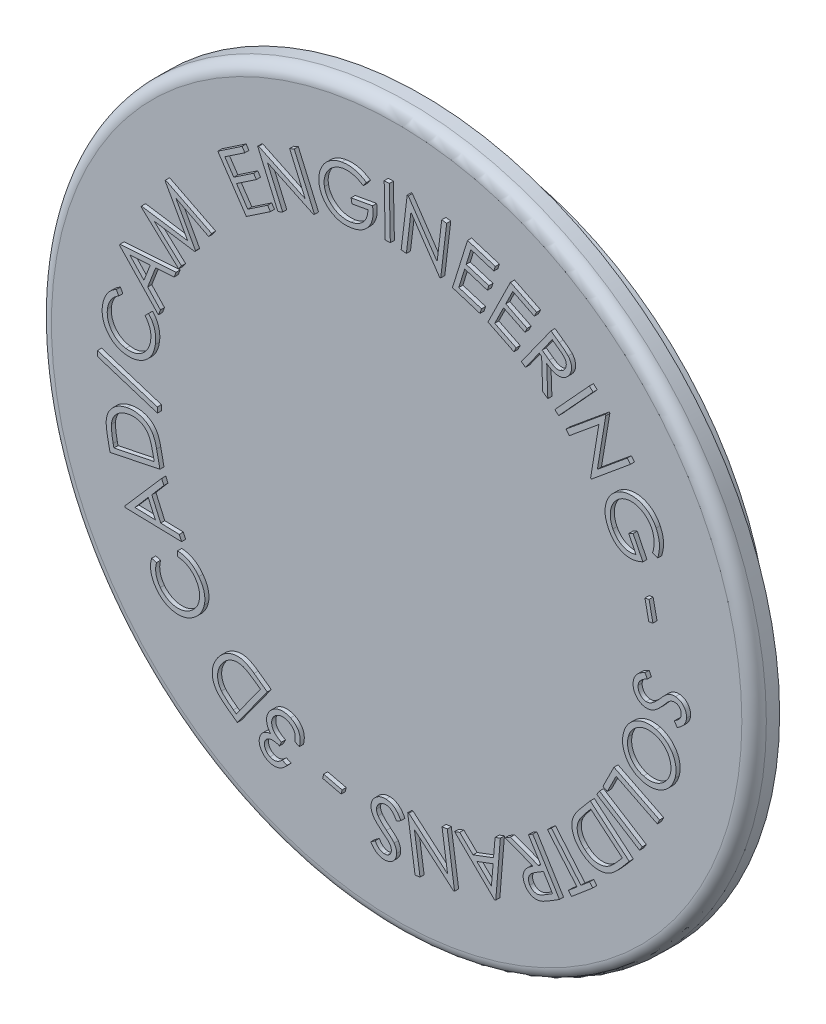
from build123d import *

# Parameters (mm, degrees)
SKETCH1_R      = 19.05
EXTRUDE1_DEPTH = 2.54
SKETCH2_R      = 22.225
EXTRUDE2_DEPTH = 1.5875
FILLET1_R      = 0.762
EXTRUDE3_DEPTH = 0.254


with BuildPart() as part:
    # Sketch1 → Extrude1 (new body)
    with BuildSketch(Plane.XY):
        with Locations((0, -38.1)):
            Circle(SKETCH1_R)
    extrude(amount=-EXTRUDE1_DEPTH)

    # Sketch2 → Extrude2 (add)
    with BuildSketch(Plane.XY):
        with Locations((0, -38.1)):
            Circle(SKETCH2_R)
    extrude(amount=EXTRUDE2_DEPTH)

    # Fillet1
    fillet1_edges = [part.edges().sort_by_distance(p)[0] for p in [
        (-22.225, -38.1, 1.5875),
    ]]
    fillet(fillet1_edges, radius=FILLET1_R)

    # Sketch3 → Extrude3 (add)
    # profile 1 of 32: a face of its own
    with BuildSketch(Plane.XY.offset(1.5875)):
        Polygon((15.946801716, -34.155117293), (16.189124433, -35.313941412), (15.932173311, -35.367366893), (15.689850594, -34.208542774), align=None)
    # profile 2 of 32: a face of its own
    with BuildSketch(Plane.XY.offset(1.5875)):
        with BuildLine():
            Line((16.479459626, -31.664015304), (16.162722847, -31.54698806))
            add(Edge.make_bspline(
                [(16.162722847, -31.54698806), (16.180322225, -31.488751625), (16.215035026, -31.373886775), (16.248110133, -31.198781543), (16.263403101, -31.024937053), (16.262018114, -30.853743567), (16.245689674, -30.687905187), (16.215380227, -30.529990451), (16.170778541, -30.381032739), (16.128779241, -30.288326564), (16.108025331, -30.242515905)],
                knots=[0, 0, 0, 0, 1.090894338, 2.151666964, 3.190250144, 4.217234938, 5.218658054, 6.175708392, 7.098528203, 8, 8, 8, 8], degree=3))
            add(Edge.make_bspline(
                [(16.108025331, -30.242515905), (16.093978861, -30.215173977), (16.065920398, -30.16055723), (16.017337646, -30.082552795), (15.964307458, -30.007911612), (15.907172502, -29.936380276), (15.844667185, -29.869029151), (15.777574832, -29.80530755), (15.706147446, -29.744614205), (15.630496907, -29.687962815), (15.551782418, -29.635803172), (15.471136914, -29.589335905), (15.388927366, -29.549101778), (15.305131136, -29.515265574), (15.219712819, -29.487233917), (15.132645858, -29.464869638), (15.044003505, -29.448931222), (14.954492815, -29.439536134), (14.865078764, -29.435986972), (14.776663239, -29.436657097), (14.689847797, -29.444892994), (14.604271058, -29.457050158), (14.520520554, -29.476637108), (14.438023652, -29.5004047), (14.357700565, -29.53128419), (14.305628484, -29.55552564), (14.27947465, -29.567701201)],
                knots=[0, 0, 0, 0, 1.02273538, 2.042960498, 3.055174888, 4.069011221, 5.087649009, 6.110798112, 7.147099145, 8.205529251, 9.2545089, 10.288139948, 11.301141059, 12.29828983, 13.293489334, 14.291237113, 15.287786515, 16.288324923, 17.284149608, 18.265063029, 19.228434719, 20.184439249, 21.139610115, 22.088531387, 23.039941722, 24, 24, 24, 24], degree=3))
            add(Edge.make_bspline(
                [(14.27947465, -29.567701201), (14.253208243, -29.581351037), (14.200992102, -29.608486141), (14.126030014, -29.6552876), (14.055372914, -29.707345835), (13.987639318, -29.763667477), (13.924468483, -29.825655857), (13.863591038, -29.891487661), (13.807725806, -29.96342237), (13.755193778, -30.039041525), (13.707474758, -30.118448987), (13.665641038, -30.200567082), (13.628869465, -30.284682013), (13.599488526, -30.371510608), (13.574172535, -30.459851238), (13.555912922, -30.550703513), (13.543216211, -30.643741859), (13.53611403, -30.738484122), (13.535755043, -30.834074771), (13.540497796, -30.929279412), (13.552286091, -31.023759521), (13.569310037, -31.117501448), (13.592786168, -31.210406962), (13.623250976, -31.302337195), (13.658348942, -31.393894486), (13.686531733, -31.453449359), (13.700698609, -31.483386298)],
                knots=[0, 0, 0, 0, 0.957516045, 1.903488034, 2.855657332, 3.795416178, 4.751063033, 5.717286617, 6.694333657, 7.69519401, 8.695137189, 9.689109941, 10.675383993, 11.662421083, 12.652718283, 13.646880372, 14.657728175, 15.689424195, 16.718380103, 17.748775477, 18.771470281, 19.796692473, 20.829846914, 21.868905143, 22.928745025, 24, 24, 24, 24], degree=3))
            add(Edge.make_bspline(
                [(13.700698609, -31.483386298), (13.71894729, -31.518931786), (13.754851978, -31.588868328), (13.818449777, -31.686017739), (13.886646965, -31.775732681), (13.960437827, -31.857528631), (14.040441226, -31.93070165), (14.125242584, -31.997006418), (14.216482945, -32.054036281), (14.312282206, -32.102934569), (14.411278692, -32.142828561), (14.511780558, -32.173896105), (14.613559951, -32.193378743), (14.715731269, -32.203671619), (14.818833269, -32.204447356), (14.922731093, -32.194636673), (15.027627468, -32.175204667), (15.096295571, -32.154212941), (15.131102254, -32.143572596)],
                knots=[0, 0, 0, 0, 1.109838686, 2.183632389, 3.221902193, 4.239756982, 5.240584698, 6.231791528, 7.227384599, 8.226128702, 9.217458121, 10.190458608, 11.144978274, 12.092451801, 13.041133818, 14.005640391, 14.98909334, 16, 16, 16, 16], degree=3))
            Line((15.131102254, -32.143572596), (14.683981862, -31.239155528))
            Line((14.683981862, -31.239155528), (14.957469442, -31.104319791))
            Line((14.957469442, -31.104319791), (15.561686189, -32.326745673))
            add(Edge.make_bspline(
                [(15.561686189, -32.326745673), (15.507599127, -32.35186051), (15.401980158, -32.400903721), (15.240113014, -32.457053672), (15.08077846, -32.496454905), (14.924193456, -32.521461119), (14.77001572, -32.529251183), (14.618417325, -32.520235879), (14.469378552, -32.495301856), (14.323750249, -32.454574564), (14.183465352, -32.398713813), (14.050140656, -32.328522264), (13.925532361, -32.243086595), (13.808888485, -32.144079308), (13.699916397, -32.031407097), (13.600094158, -31.903751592), (13.507443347, -31.762584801), (13.454327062, -31.660696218), (13.427211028, -31.60868177)],
                knots=[0, 0, 0, 0, 1.125682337, 2.198185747, 3.229472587, 4.222146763, 5.188271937, 6.138840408, 7.084717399, 8.036735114, 8.989156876, 9.931246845, 10.876309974, 11.836518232, 12.816245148, 13.831126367, 14.89278308, 16, 16, 16, 16], degree=3))
            add(Edge.make_bspline(
                [(13.427211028, -31.60868177), (13.411644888, -31.576169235), (13.380808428, -31.511762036), (13.34042799, -31.414064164), (13.304980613, -31.316999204), (13.275929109, -31.220266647), (13.25164031, -31.123940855), (13.232237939, -31.028303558), (13.219740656, -30.932851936), (13.212088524, -30.838181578), (13.209275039, -30.743683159), (13.212782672, -30.649849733), (13.220536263, -30.556288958), (13.23594321, -30.463707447), (13.254296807, -30.371043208), (13.280359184, -30.279552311), (13.310698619, -30.188191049), (13.334875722, -30.128336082), (13.347072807, -30.098139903)],
                knots=[0, 0, 0, 0, 1.106070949, 2.191122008, 3.242830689, 4.276083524, 5.28916683, 6.290820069, 7.268953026, 8.241530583, 9.204814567, 10.168296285, 11.121974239, 12.083608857, 13.047002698, 14.019384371, 15.000800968, 16, 16, 16, 16], degree=3))
            add(Edge.make_bspline(
                [(13.347072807, -30.098139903), (13.367659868, -30.052776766), (13.408289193, -29.963250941), (13.482978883, -29.837504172), (13.566643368, -29.720512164), (13.659287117, -29.612221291), (13.762139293, -29.513396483), (13.874363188, -29.424009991), (13.995443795, -29.341957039), (14.082661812, -29.296753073), (14.126830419, -29.273861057)],
                knots=[0, 0, 0, 0, 1.030411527, 2.033555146, 3.021078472, 4.004361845, 4.978793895, 5.968333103, 6.971131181, 8, 8, 8, 8], degree=3))
            add(Edge.make_bspline(
                [(14.126830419, -29.273861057), (14.160543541, -29.2579063), (14.227260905, -29.226332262), (14.330489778, -29.187592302), (14.434802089, -29.155782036), (14.540538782, -29.130706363), (14.647920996, -29.113664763), (14.756486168, -29.103484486), (14.866522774, -29.100400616), (14.977250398, -29.103919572), (15.087419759, -29.11576208), (15.195947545, -29.133047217), (15.301862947, -29.158950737), (15.405456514, -29.191105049), (15.506502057, -29.230937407), (15.605254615, -29.277520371), (15.701924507, -29.330720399), (15.795337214, -29.391488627), (15.885703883, -29.457773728), (15.970936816, -29.531373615), (16.051851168, -29.61039542), (16.128543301, -29.695027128), (16.199641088, -29.786364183), (16.266429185, -29.883247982), (16.329204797, -29.985534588), (16.366071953, -30.057393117), (16.384693, -30.09368778)],
                knots=[0, 0, 0, 0, 1.001462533, 1.981867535, 2.958195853, 3.929212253, 4.898155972, 5.876160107, 6.856019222, 7.853133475, 8.849255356, 9.830354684, 10.802689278, 11.77525729, 12.741771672, 13.717402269, 14.706336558, 15.703011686, 16.708674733, 17.714208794, 18.724953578, 19.745023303, 20.779361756, 21.831356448, 22.904650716, 24, 24, 24, 24], degree=3))
            add(Edge.make_bspline(
                [(16.384693, -30.09368778), (16.412337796, -30.153849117), (16.466954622, -30.272707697), (16.528367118, -30.458031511), (16.569537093, -30.64611506), (16.588704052, -30.805143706), (16.595067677, -30.93382092), (16.593182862, -31.03252012), (16.588003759, -31.133191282), (16.575880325, -31.235588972), (16.560470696, -31.340139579), (16.538282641, -31.446525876), (16.511997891, -31.555064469), (16.490386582, -31.627427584), (16.479459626, -31.664015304)],
                knots=[0, 0, 0, 0, 1.475289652, 2.914676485, 4.342476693, 5.761251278, 6.480459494, 7.213147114, 7.961164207, 8.726891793, 9.511012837, 10.316552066, 11.14882711, 12, 12, 12, 12], degree=3))
        make_face()
    # profile 3 of 32: a face of its own
    with BuildSketch(Plane.XY.offset(1.5875)):
        Polygon((10.785437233, -27.565928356), (13.211844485, -25.558656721), (13.255729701, -25.611446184), (12.733559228, -28.761641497), (14.590730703, -27.225022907), (14.788532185, -27.464165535), (12.362124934, -29.47143717), (12.316967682, -29.416739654), (12.82705382, -26.29898124), (10.99277898, -27.816519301), align=None)
    # profile 4 of 32: a face of its own
    with BuildSketch(Plane.XY.offset(1.5875)):
        Polygon((12.235340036, -24.520340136), (12.469394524, -24.734678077), (10.325379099, -27.073950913), (10.091324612, -26.859612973), align=None)
    # profile 5 of 32: a face of its own
    with BuildSketch(Plane.XY.offset(1.5875)):
        with BuildLine():
            Line((9.84883714, -22.745215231), (10.361467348, -23.112197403))
            add(Edge.make_bspline(
                [(10.361467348, -23.112197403), (10.395634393, -23.136954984), (10.460978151, -23.18430334), (10.554317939, -23.253069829), (10.63780116, -23.316971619), (10.712156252, -23.375740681), (10.776966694, -23.429475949), (10.832081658, -23.478504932), (10.878758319, -23.521385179), (10.904799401, -23.550031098), (10.916710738, -23.563133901)],
                knots=[0, 0, 0, 0, 1.413556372, 2.703396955, 3.883885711, 4.935438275, 5.878466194, 6.703639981, 7.407037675, 8, 8, 8, 8], degree=3))
            add(Edge.make_bspline(
                [(10.916710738, -23.563133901), (10.93204206, -23.581143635), (10.962363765, -23.6167626), (11.002495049, -23.673487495), (11.036952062, -23.732323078), (11.066307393, -23.792931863), (11.090682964, -23.855361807), (11.109206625, -23.919873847), (11.121753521, -23.986334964), (11.129422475, -24.053930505), (11.131560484, -24.122260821), (11.1268171, -24.190114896), (11.117055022, -24.257561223), (11.099237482, -24.323737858), (11.076657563, -24.389794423), (11.046323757, -24.454369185), (11.010597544, -24.518707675), (10.982558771, -24.55977342), (10.968228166, -24.580762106)],
                knots=[0, 0, 0, 0, 1.025286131, 2.027771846, 3.008522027, 3.97891882, 4.94525691, 5.911332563, 6.884990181, 7.874876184, 8.858981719, 9.84480352, 10.821278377, 11.809112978, 12.812230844, 13.844746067, 14.898450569, 16, 16, 16, 16], degree=3))
            add(Edge.make_bspline(
                [(10.968228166, -24.580762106), (10.942815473, -24.61396389), (10.893214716, -24.678767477), (10.80524353, -24.761498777), (10.71018631, -24.829902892), (10.606965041, -24.881405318), (10.498503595, -24.917792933), (10.385248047, -24.935187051), (10.268472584, -24.936680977), (10.169292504, -24.922485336), (10.087733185, -24.902391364), (10.023389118, -24.881169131), (9.956386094, -24.854155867), (9.886805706, -24.82179127), (9.814520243, -24.783872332), (9.739677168, -24.740841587), (9.662461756, -24.691463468), (9.610853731, -24.655766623), (9.584253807, -24.637367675)],
                knots=[0, 0, 0, 0, 1.272817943, 2.484299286, 3.666110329, 4.830922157, 5.987709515, 7.139503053, 8.309378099, 9.535987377, 10.18180282, 10.868525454, 11.599416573, 12.383040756, 13.20691528, 14.087118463, 15.014058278, 16, 16, 16, 16], degree=3))
            Line((9.584253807, -24.637367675), (9.65294371, -26.496447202))
            Line((9.65294371, -26.496447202), (9.334934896, -26.268752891))
            Line((9.334934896, -26.268752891), (9.268153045, -24.410945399))
            Line((9.268153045, -24.410945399), (9.121232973, -24.306002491))
            Line((9.121232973, -24.306002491), (8.264517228, -25.502351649))
            Line((8.264517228, -25.502351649), (8.006930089, -25.317906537))
            Line((8.006930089, -25.317906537), (9.84883714, -22.745215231))
        make_face()
        with BuildLine():
            Line((9.925795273, -23.181523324), (9.299953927, -24.056047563))
            Line((9.299953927, -24.056047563), (9.739442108, -24.375328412))
            add(Edge.make_bspline(
                [(9.739442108, -24.375328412), (9.760364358, -24.390050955), (9.8008101, -24.418511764), (9.860380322, -24.458146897), (9.917394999, -24.492296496), (9.970390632, -24.523256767), (10.021165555, -24.54864048), (10.068255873, -24.570415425), (10.112665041, -24.587265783), (10.166863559, -24.603179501), (10.232660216, -24.614520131), (10.310470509, -24.615664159), (10.387062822, -24.605863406), (10.460852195, -24.582374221), (10.530776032, -24.548877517), (10.594746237, -24.505234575), (10.652558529, -24.45239054), (10.684715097, -24.411031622), (10.701100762, -24.389956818)],
                knots=[0, 0, 0, 0, 1.120204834, 2.165518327, 3.131883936, 4.029984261, 4.851985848, 5.616408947, 6.30089814, 6.929540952, 8.087868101, 9.211260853, 10.325874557, 11.453363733, 12.586836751, 13.709423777, 14.832816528, 16, 16, 16, 16], degree=3))
            add(Edge.make_bspline(
                [(10.701100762, -24.389956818), (10.715273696, -24.368043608), (10.7431739, -24.324906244), (10.774293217, -24.254567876), (10.793303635, -24.180641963), (10.801447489, -24.104583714), (10.799042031, -24.028765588), (10.78591087, -23.95522461), (10.760514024, -23.885900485), (10.730679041, -23.830993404), (10.700831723, -23.787058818), (10.670711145, -23.753213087), (10.636851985, -23.715799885), (10.595458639, -23.678262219), (10.549875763, -23.637285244), (10.498337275, -23.594542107), (10.440153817, -23.551141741), (10.399645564, -23.521344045), (10.378639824, -23.505892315)],
                knots=[0, 0, 0, 0, 1.165481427, 2.294314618, 3.420757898, 4.564768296, 5.702755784, 6.801423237, 7.889739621, 8.988079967, 9.587519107, 10.259853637, 11.010948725, 11.842420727, 12.755459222, 13.751773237, 14.834171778, 16, 16, 16, 16], degree=3))
            Line((10.378639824, -23.505892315), (9.925795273, -23.181523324))
        make_face(mode=Mode.SUBTRACT)
    # profile 6 of 32: a face of its own
    with BuildSketch(Plane.XY.offset(1.5875)):
        Polygon((7.328407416, -21.392204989), (8.953432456, -22.19104313), (8.815416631, -22.470890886), (7.473419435, -21.811340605), (7.037111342, -22.697949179), (8.36766022, -23.352411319), (8.231552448, -23.629715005), (6.90100357, -22.975252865), (6.353392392, -24.087647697), (7.68394127, -24.742109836), (7.546561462, -25.021957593), (5.93298474, -24.228207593), align=None)
    # profile 7 of 32: a face of its own
    with BuildSketch(Plane.XY.offset(1.5875)):
        Polygon((4.662168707, -20.467219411), (6.38832055, -21.005290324), (6.296097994, -21.302310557), (4.871418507, -20.858370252), (4.577578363, -21.800312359), (5.989537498, -22.240436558), (5.897950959, -22.53491272), (4.485991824, -22.094788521), (4.118373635, -23.275873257), (5.53033277, -23.715997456), (5.437474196, -24.013017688), (3.724042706, -23.47876288), align=None)
    # profile 8 of 32: a face of its own
    with BuildSketch(Plane.XY.offset(1.5875)):
        Polygon((0.536952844, -23.033578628), (0.909659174, -19.905007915), (0.97771306, -19.913276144), (2.772554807, -22.555293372), (3.057490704, -20.160687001), (3.365959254, -20.197576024), (2.993252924, -23.326146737), (2.923290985, -23.317878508), (1.141805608, -20.707026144), (0.860049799, -23.071739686), align=None)
    # profile 9 of 32: a face of its own
    with BuildSketch(Plane.XY.offset(1.5875)):
        Polygon((-0.519743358, -19.843007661), (-0.204278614, -19.836647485), (-0.138768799, -22.994475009), (-0.454233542, -23.000835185), align=None)
    # profile 10 of 32: a face of its own
    with BuildSketch(Plane.XY.offset(1.5875)):
        with BuildLine():
            Line((-1.623675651, -20.495403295), (-1.822113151, -20.766346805))
            add(Edge.make_bspline(
                [(-1.822113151, -20.766346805), (-1.873022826, -20.733293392), (-1.973272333, -20.668205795), (-2.132523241, -20.589583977), (-2.294124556, -20.52608726), (-2.458025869, -20.479804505), (-2.621007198, -20.449933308), (-2.780447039, -20.435862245), (-2.935422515, -20.436335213), (-3.035739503, -20.451185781), (-3.08524416, -20.458514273)],
                knots=[0, 0, 0, 0, 1.092931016, 2.152160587, 3.193584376, 4.217883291, 5.215951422, 6.174686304, 7.099240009, 8, 8, 8, 8], degree=3))
            add(Edge.make_bspline(
                [(-3.08524416, -20.458514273), (-3.115434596, -20.464498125), (-3.175399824, -20.476383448), (-3.263585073, -20.500825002), (-3.349646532, -20.530731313), (-3.433494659, -20.56638633), (-3.515176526, -20.60733441), (-3.594982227, -20.65315519), (-3.672704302, -20.704828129), (-3.747683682, -20.76177862), (-3.819447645, -20.822283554), (-3.88570037, -20.886907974), (-3.947067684, -20.954148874), (-4.002314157, -21.025386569), (-4.053648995, -21.098685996), (-4.098012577, -21.176280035), (-4.137636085, -21.256534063), (-4.171659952, -21.339462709), (-4.200579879, -21.423899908), (-4.222259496, -21.509139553), (-4.240165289, -21.594100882), (-4.250661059, -21.679418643), (-4.255812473, -21.764813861), (-4.255351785, -21.850262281), (-4.248202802, -21.935663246), (-4.239519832, -21.992207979), (-4.235164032, -22.020573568)],
                knots=[0, 0, 0, 0, 1.028883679, 2.043602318, 3.056982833, 4.073482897, 5.088003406, 6.110640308, 7.148787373, 8.20650122, 9.257637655, 10.285372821, 11.299199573, 12.298999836, 13.297945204, 14.288935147, 15.284453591, 16.288942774, 17.284309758, 18.266128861, 19.228221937, 20.18578589, 21.137427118, 22.087403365, 23.040548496, 24, 24, 24, 24], degree=3))
            add(Edge.make_bspline(
                [(-4.235164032, -22.020573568), (-4.229445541, -22.049507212), (-4.218078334, -22.107021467), (-4.193441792, -22.191313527), (-4.163548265, -22.273561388), (-4.127961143, -22.353741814), (-4.086384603, -22.431674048), (-4.039037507, -22.507239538), (-3.987131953, -22.581538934), (-3.92837731, -22.652092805), (-3.866266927, -22.720173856), (-3.798827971, -22.782302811), (-3.728929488, -22.84087155), (-3.654374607, -22.893271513), (-3.576586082, -22.9413932), (-3.494748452, -22.983814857), (-3.409666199, -23.0223919), (-3.320557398, -23.054305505), (-3.229603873, -23.081839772), (-3.137087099, -23.102673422), (-3.043866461, -23.11802952), (-2.949566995, -23.127776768), (-2.854163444, -23.130667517), (-2.757729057, -23.128282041), (-2.660431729, -23.119403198), (-2.595670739, -23.108965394), (-2.563073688, -23.103711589)],
                knots=[0, 0, 0, 0, 0.958391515, 1.905089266, 2.851335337, 3.801638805, 4.754363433, 5.720160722, 6.699220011, 7.698163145, 8.702843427, 9.692734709, 10.676657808, 11.665324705, 12.652332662, 13.648060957, 14.659949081, 15.686864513, 16.722622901, 17.747524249, 18.767268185, 19.792517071, 20.82689873, 21.867963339, 22.926852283, 24, 24, 24, 24], degree=3))
            add(Edge.make_bspline(
                [(-2.563073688, -23.103711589), (-2.524133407, -23.095835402), (-2.447441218, -23.080323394), (-2.33661424, -23.047026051), (-2.232095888, -23.006170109), (-2.133307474, -22.958728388), (-2.041694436, -22.902058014), (-1.955016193, -22.839317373), (-1.875664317, -22.767403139), (-1.801961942, -22.689618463), (-1.736002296, -22.606073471), (-1.679166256, -22.51808971), (-1.631877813, -22.426437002), (-1.593206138, -22.331677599), (-1.565776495, -22.232907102), (-1.545347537, -22.131397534), (-1.535994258, -22.025839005), (-1.536778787, -21.954439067), (-1.537177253, -21.91817473)],
                knots=[0, 0, 0, 0, 1.109195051, 2.184539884, 3.22697067, 4.24125539, 5.240547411, 6.231842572, 7.22566351, 8.22679593, 9.221868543, 10.19421859, 11.147633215, 12.098765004, 13.047146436, 14.006372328, 14.987427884, 16, 16, 16, 16], degree=3))
            Line((-1.537177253, -21.91817473), (-2.525548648, -22.095623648))
            Line((-2.525548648, -22.095623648), (-2.578974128, -21.796695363))
            Line((-2.578974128, -21.796695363), (-1.242701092, -21.556280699))
            add(Edge.make_bspline(
                [(-1.242701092, -21.556280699), (-1.233937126, -21.6148989), (-1.216818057, -21.729400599), (-1.207134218, -21.899439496), (-1.212675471, -22.062742), (-1.232922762, -22.219325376), (-1.267665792, -22.369161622), (-1.318494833, -22.511549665), (-1.382924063, -22.64765976), (-1.462492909, -22.775525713), (-1.554329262, -22.894705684), (-1.659079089, -23.001908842), (-1.773799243, -23.098809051), (-1.900847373, -23.182871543), (-2.038790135, -23.25584094), (-2.188735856, -23.315693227), (-2.349109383, -23.366159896), (-2.461267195, -23.388622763), (-2.518552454, -23.400095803)],
                knots=[0, 0, 0, 0, 1.124006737, 2.195575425, 3.225859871, 4.219635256, 5.186446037, 6.137985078, 7.082485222, 8.037917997, 8.989661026, 9.931141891, 10.876121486, 11.833237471, 12.815576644, 13.831344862, 14.892346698, 16, 16, 16, 16], degree=3))
            add(Edge.make_bspline(
                [(-2.518552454, -23.400095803), (-2.55391666, -23.405873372), (-2.624033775, -23.417328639), (-2.728615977, -23.429661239), (-2.8313871, -23.435594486), (-2.931993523, -23.438145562), (-3.030678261, -23.43377993), (-3.127567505, -23.426042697), (-3.222260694, -23.411902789), (-3.314933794, -23.392537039), (-3.405897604, -23.369181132), (-3.495102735, -23.340841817), (-3.581581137, -23.305904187), (-3.66670455, -23.267462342), (-3.749093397, -23.222473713), (-3.830387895, -23.173670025), (-3.909090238, -23.118846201), (-3.959741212, -23.079150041), (-3.985209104, -23.059190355)],
                knots=[0, 0, 0, 0, 1.104700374, 2.19030517, 3.244666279, 4.277576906, 5.29145146, 6.288585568, 7.27304263, 8.240868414, 9.206329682, 10.167511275, 11.123947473, 12.080339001, 13.045401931, 14.016158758, 15.002501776, 16, 16, 16, 16], degree=3))
            add(Edge.make_bspline(
                [(-3.985209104, -23.059190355), (-4.022704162, -23.026979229), (-4.096963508, -22.963184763), (-4.196712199, -22.857027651), (-4.285585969, -22.744623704), (-4.36355953, -22.626017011), (-4.430155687, -22.500661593), (-4.484726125, -22.368538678), (-4.528623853, -22.229791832), (-4.548293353, -22.133993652), (-4.558260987, -22.085447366)],
                knots=[0, 0, 0, 0, 1.026942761, 2.033870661, 3.022226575, 4.002522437, 4.98035853, 5.968203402, 6.970375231, 8, 8, 8, 8], degree=3))
            add(Edge.make_bspline(
                [(-4.558260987, -22.085447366), (-4.564053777, -22.049044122), (-4.575598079, -21.976497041), (-4.584058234, -21.867241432), (-4.586358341, -21.758468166), (-4.580346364, -21.650539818), (-4.567863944, -21.543171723), (-4.547107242, -21.436605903), (-4.519884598, -21.330572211), (-4.485710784, -21.225730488), (-4.44423524, -21.123743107), (-4.397456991, -21.024867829), (-4.34363728, -20.93044071), (-4.284124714, -20.840191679), (-4.218009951, -20.754705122), (-4.146884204, -20.672901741), (-4.068770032, -20.595890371), (-3.98532694, -20.52292548), (-3.896141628, -20.455534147), (-3.802504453, -20.394019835), (-3.705121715, -20.337292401), (-3.602356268, -20.288904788), (-3.495852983, -20.245350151), (-3.385026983, -20.207837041), (-3.269727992, -20.176348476), (-3.190723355, -20.160993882), (-3.150753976, -20.153225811)],
                knots=[0, 0, 0, 0, 0.994600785, 1.982114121, 2.955078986, 3.929254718, 4.897411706, 5.87044388, 6.857260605, 7.850741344, 8.844304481, 9.827181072, 10.80100379, 11.775498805, 12.742657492, 13.715942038, 14.699218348, 15.701036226, 16.705905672, 17.713736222, 18.723757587, 19.74501528, 20.776847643, 21.828234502, 22.901278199, 24, 24, 24, 24], degree=3))
            add(Edge.make_bspline(
                [(-3.150753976, -20.153225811), (-3.085809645, -20.143186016), (-2.957079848, -20.123285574), (-2.763060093, -20.117308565), (-2.571793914, -20.12833218), (-2.41453928, -20.153795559), (-2.290033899, -20.184458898), (-2.195972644, -20.212384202), (-2.101323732, -20.245744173), (-2.006265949, -20.284189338), (-1.911010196, -20.329322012), (-1.815322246, -20.379396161), (-1.719019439, -20.434829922), (-1.655753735, -20.475023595), (-1.623675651, -20.495403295)],
                knots=[0, 0, 0, 0, 1.471703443, 2.917145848, 4.340456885, 5.760623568, 6.479754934, 7.213417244, 7.958803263, 8.728230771, 9.510463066, 10.320223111, 11.148290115, 12, 12, 12, 12], degree=3))
        make_face()
    # profile 11 of 32: a face of its own
    with BuildSketch(Plane.XY.offset(1.5875)):
        Polygon((-7.127848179, -24.815173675), (-8.387163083, -21.920657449), (-8.324197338, -21.893308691), (-5.435405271, -23.271558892), (-6.399607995, -21.055673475), (-6.114672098, -20.932286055), (-4.855357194, -23.826802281), (-4.920230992, -23.854787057), (-7.780402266, -22.49688942), (-6.828919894, -24.684790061), align=None)
    # profile 12 of 32: a face of its own
    with BuildSketch(Plane.XY.offset(1.5875)):
        Polygon((-10.864802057, -23.42759781), (-9.35680426, -22.410605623), (-9.181899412, -22.670100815), (-10.426585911, -23.509644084), (-9.871978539, -24.332014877), (-8.63810434, -23.499467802), (-8.464471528, -23.757054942), (-9.698345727, -24.589602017), (-9.001906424, -25.621858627), (-7.768032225, -24.789311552), (-7.593127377, -25.048806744), (-9.090312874, -26.058802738), align=None)
    # profile 13 of 32: a face of its own
    with BuildSketch(Plane.XY.offset(1.5875)):
        Polygon((-13.297816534, -30.983174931), (-15.642177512, -28.798454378), (-15.612284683, -28.755841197), (-12.739393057, -29.187697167), (-14.144355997, -26.651258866), (-14.114463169, -26.608645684), (-11.252383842, -28.050497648), (-11.431104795, -28.306812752), (-13.470177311, -27.263743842), (-12.250295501, -29.481537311), (-12.29608877, -29.547047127), (-14.821714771, -29.171160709), (-13.122911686, -30.732583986), align=None)
    # profile 14 of 32: a face of its own
    with BuildSketch(Plane.XY.offset(1.5875)):
        Polygon((-16.943022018, -31.475343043), (-13.45637338, -31.243196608), (-13.579124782, -31.560569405), (-14.730952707, -31.647067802), (-15.224502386, -32.919739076), (-14.431388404, -33.758646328), (-14.559227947, -34.087467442), (-16.971642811, -31.547849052), align=None)
        Polygon((-16.330537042, -31.754554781), (-15.457920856, -32.676780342), (-15.066133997, -31.667420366), align=None, mode=Mode.SUBTRACT)
    # profile 15 of 32: a face of its own
    with BuildSketch(Plane.XY.offset(1.5875)):
        with BuildLine():
            Line((-17.174651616, -34.029812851), (-17.021371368, -34.303936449))
            add(Edge.make_bspline(
                [(-17.021371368, -34.303936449), (-17.045522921, -34.317828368), (-17.093639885, -34.345505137), (-17.161798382, -34.392234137), (-17.227336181, -34.440990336), (-17.288058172, -34.494218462), (-17.346259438, -34.549358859), (-17.400611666, -34.608070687), (-17.450555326, -34.67041664), (-17.497129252, -34.73534471), (-17.539748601, -34.802911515), (-17.578737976, -34.872819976), (-17.613017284, -34.945628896), (-17.643412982, -35.020634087), (-17.670478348, -35.097757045), (-17.692463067, -35.17753223), (-17.711174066, -35.259640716), (-17.720231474, -35.315571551), (-17.724806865, -35.343825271)],
                knots=[0, 0, 0, 0, 1.025980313, 2.044053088, 3.042159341, 4.033274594, 5.016512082, 5.994743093, 6.977825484, 7.957427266, 8.93677996, 9.919117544, 10.904276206, 11.899169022, 12.899472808, 13.913252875, 14.945870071, 16, 16, 16, 16], degree=3))
            add(Edge.make_bspline(
                [(-17.724806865, -35.343825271), (-17.728790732, -35.374951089), (-17.736684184, -35.43662236), (-17.741773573, -35.529059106), (-17.740370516, -35.620411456), (-17.73340368, -35.710908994), (-17.720644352, -35.800769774), (-17.702181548, -35.889778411), (-17.678132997, -35.977862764), (-17.647487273, -36.063967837), (-17.611885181, -36.147795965), (-17.572069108, -36.228468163), (-17.527414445, -36.305313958), (-17.477581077, -36.377617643), (-17.424080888, -36.446610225), (-17.366321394, -36.511920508), (-17.30269395, -36.571899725), (-17.236494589, -36.629746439), (-17.164926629, -36.681143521), (-17.091286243, -36.729648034), (-17.013329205, -36.771326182), (-16.932583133, -36.808233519), (-16.848894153, -36.840135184), (-16.762112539, -36.867133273), (-16.671840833, -36.887809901), (-16.610348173, -36.898134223), (-16.579339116, -36.903340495)],
                knots=[0, 0, 0, 0, 1.046251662, 2.072995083, 3.084137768, 4.09111915, 5.098001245, 6.108847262, 7.120854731, 8.140538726, 9.154322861, 10.156652, 11.138880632, 12.115495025, 13.082852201, 14.049304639, 15.019396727, 15.997162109, 16.978576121, 17.955216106, 18.935916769, 19.923044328, 20.914416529, 21.920777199, 22.951505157, 24, 24, 24, 24], degree=3))
            add(Edge.make_bspline(
                [(-16.579339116, -36.903340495), (-16.532347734, -36.909148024), (-16.440087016, -36.920550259), (-16.302588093, -36.921482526), (-16.16947292, -36.909398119), (-16.040231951, -36.884662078), (-15.914999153, -36.846418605), (-15.794195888, -36.794237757), (-15.677200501, -36.729874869), (-15.566002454, -36.652414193), (-15.462098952, -36.564625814), (-15.368378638, -36.467490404), (-15.284707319, -36.362774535), (-15.213667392, -36.248864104), (-15.152790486, -36.127331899), (-15.103289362, -35.997809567), (-15.064541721, -35.860053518), (-15.048413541, -35.764630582), (-15.040176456, -35.715895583)],
                knots=[0, 0, 0, 0, 1.044553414, 2.050828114, 3.028351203, 3.991199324, 4.950526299, 5.912885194, 6.891136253, 7.893386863, 8.899530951, 9.8891686, 10.868605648, 11.852861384, 12.847047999, 13.864836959, 14.909516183, 16, 16, 16, 16], degree=3))
            add(Edge.make_bspline(
                [(-15.040176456, -35.715895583), (-15.033953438, -35.661914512), (-15.021704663, -35.555663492), (-15.023099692, -35.396842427), (-15.042414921, -35.242668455), (-15.078195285, -35.092630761), (-15.131089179, -34.946942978), (-15.202313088, -34.806367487), (-15.288511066, -34.668846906), (-15.358653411, -34.584303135), (-15.394438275, -34.541171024)],
                knots=[0, 0, 0, 0, 1.027663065, 2.022750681, 2.997182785, 3.962577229, 4.936116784, 5.923016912, 6.940375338, 8, 8, 8, 8], degree=3))
            Line((-15.394438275, -34.541171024), (-15.171196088, -34.32238096))
            add(Edge.make_bspline(
                [(-15.171196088, -34.32238096), (-15.149673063, -34.345633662), (-15.106821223, -34.39192925), (-15.048407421, -34.466223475), (-14.994436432, -34.54318394), (-14.944286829, -34.622855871), (-14.900047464, -34.706133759), (-14.860636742, -34.792260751), (-14.825339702, -34.881126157), (-14.795093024, -34.972897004), (-14.769455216, -35.067087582), (-14.749735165, -35.163320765), (-14.735880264, -35.261482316), (-14.727083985, -35.361467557), (-14.722839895, -35.463167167), (-14.72600056, -35.566758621), (-14.733251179, -35.672063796), (-14.742373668, -35.742645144), (-14.74697233, -35.778225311)],
                knots=[0, 0, 0, 0, 0.967628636, 1.926526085, 2.884241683, 3.838512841, 4.800489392, 5.762640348, 6.730810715, 7.7200468, 8.712986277, 9.711360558, 10.718894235, 11.739766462, 12.776762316, 13.826302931, 14.904235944, 16, 16, 16, 16], degree=3))
            add(Edge.make_bspline(
                [(-14.74697233, -35.778225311), (-14.75244672, -35.811978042), (-14.763226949, -35.878444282), (-14.783550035, -35.976387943), (-14.808344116, -36.070797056), (-14.836841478, -36.161918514), (-14.869658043, -36.249449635), (-14.905386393, -36.334095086), (-14.94659499, -36.414777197), (-14.990337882, -36.492693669), (-15.038134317, -36.56736838), (-15.090146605, -36.638562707), (-15.146688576, -36.705905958), (-15.205462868, -36.771267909), (-15.269234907, -36.832232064), (-15.337187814, -36.889435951), (-15.407976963, -36.944545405), (-15.458232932, -36.977656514), (-15.483480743, -36.994291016)],
                knots=[0, 0, 0, 0, 1.117155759, 2.199915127, 3.266804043, 4.30524962, 5.317868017, 6.320198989, 7.305315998, 8.276204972, 9.238879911, 10.200407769, 11.154722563, 12.110870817, 13.071100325, 14.034323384, 15.012474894, 16, 16, 16, 16], degree=3))
            add(Edge.make_bspline(
                [(-15.483480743, -36.994291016), (-15.526925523, -37.020321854), (-15.613273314, -37.072058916), (-15.749997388, -37.135116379), (-15.891206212, -37.183893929), (-16.035995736, -37.220772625), (-16.18540518, -37.242668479), (-16.338774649, -37.252155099), (-16.496536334, -37.24874325), (-16.602102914, -37.235632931), (-16.655661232, -37.228981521)],
                knots=[0, 0, 0, 0, 0.994231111, 1.976063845, 2.950566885, 3.925141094, 4.906240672, 5.911709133, 6.940523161, 8, 8, 8, 8], degree=3))
            add(Edge.make_bspline(
                [(-16.655661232, -37.228981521), (-16.711637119, -37.219189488), (-16.821771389, -37.199923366), (-16.980923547, -37.153900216), (-17.130752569, -37.092936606), (-17.271898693, -37.018577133), (-17.403714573, -36.929432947), (-17.526439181, -36.8264442), (-17.64001659, -36.709293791), (-17.743683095, -36.579708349), (-17.834694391, -36.440200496), (-17.91072926, -36.293748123), (-17.971936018, -36.142071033), (-18.016331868, -35.984442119), (-18.045079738, -35.821434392), (-18.057526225, -35.653167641), (-18.054608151, -35.479383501), (-18.040475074, -35.362607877), (-18.033275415, -35.303120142)],
                knots=[0, 0, 0, 0, 1.030939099, 2.028404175, 3.000271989, 3.962561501, 4.918884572, 5.883134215, 6.865550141, 7.87581983, 8.890886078, 9.884013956, 10.866588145, 11.854535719, 12.850998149, 13.866006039, 14.912902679, 16, 16, 16, 16], degree=3))
            add(Edge.make_bspline(
                [(-18.033275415, -35.303120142), (-18.02752021, -35.267007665), (-18.01615443, -35.195690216), (-17.9924905, -35.091211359), (-17.963398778, -34.990374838), (-17.931191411, -34.892420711), (-17.891414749, -34.798673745), (-17.848870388, -34.707421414), (-17.799495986, -34.620493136), (-17.746073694, -34.536998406), (-17.688332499, -34.457357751), (-17.625798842, -34.382614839), (-17.560482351, -34.311615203), (-17.490756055, -34.246022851), (-17.417533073, -34.184780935), (-17.340347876, -34.128208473), (-17.259742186, -34.075589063), (-17.203079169, -34.045106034), (-17.174651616, -34.029812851)],
                knots=[0, 0, 0, 0, 1.099120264, 2.170619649, 3.217653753, 4.253591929, 5.267935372, 6.277119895, 7.27872914, 8.270537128, 9.255956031, 10.233553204, 11.198646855, 12.154436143, 13.109183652, 14.066501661, 15.029973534, 16, 16, 16, 16], degree=3))
        make_face()
    # profile 16 of 32: a face of its own
    with BuildSketch(Plane.XY.offset(1.5875)):
        Polygon((-18.340795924, -37.896921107), (-14.628361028, -39.080549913), (-14.616912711, -39.408735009), (-18.329347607, -38.227650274), align=None)
    # profile 17 of 32: a face of its own
    with BuildSketch(Plane.XY.offset(1.5875)):
        with BuildLine():
            Line((-14.463956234, -42.35465054), (-17.563270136, -42.996392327))
            Line((-17.563270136, -42.996392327), (-17.696197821, -42.354014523))
            add(Edge.make_bspline(
                [(-17.696197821, -42.354014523), (-17.707542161, -42.298105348), (-17.729449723, -42.190136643), (-17.75597197, -42.032910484), (-17.777124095, -41.887019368), (-17.792569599, -41.752354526), (-17.802659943, -41.628896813), (-17.805652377, -41.51641034), (-17.804263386, -41.414992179), (-17.796952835, -41.351616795), (-17.793508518, -41.321757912)],
                knots=[0, 0, 0, 0, 1.315173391, 2.539790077, 3.675497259, 4.713473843, 5.664537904, 6.530024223, 7.307430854, 8, 8, 8, 8], degree=3))
            add(Edge.make_bspline(
                [(-17.793508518, -41.321757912), (-17.78733902, -41.282207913), (-17.775136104, -41.203980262), (-17.746260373, -41.089687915), (-17.708533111, -40.980044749), (-17.662915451, -40.874686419), (-17.607933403, -40.774577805), (-17.544339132, -40.679371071), (-17.473263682, -40.588056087), (-17.392928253, -40.5023996), (-17.305378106, -40.422648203), (-17.211520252, -40.348789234), (-17.110599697, -40.283115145), (-17.004239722, -40.222564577), (-16.890729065, -40.170840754), (-16.771227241, -40.125763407), (-16.645927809, -40.08627791), (-16.559166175, -40.067094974), (-16.515113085, -40.057354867)],
                knots=[0, 0, 0, 0, 0.997059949, 1.972127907, 2.932763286, 3.883821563, 4.829523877, 5.774591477, 6.734180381, 7.709749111, 8.696963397, 9.682961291, 10.682258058, 11.694665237, 12.730010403, 13.786727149, 14.87621403, 16, 16, 16, 16], degree=3))
            add(Edge.make_bspline(
                [(-16.515113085, -40.057354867), (-16.476806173, -40.050182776), (-16.401120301, -40.036012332), (-16.287754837, -40.021737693), (-16.176417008, -40.015800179), (-16.067433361, -40.015196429), (-15.960763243, -40.023106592), (-15.856219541, -40.03769418), (-15.753731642, -40.059202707), (-15.654053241, -40.088098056), (-15.557914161, -40.121969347), (-15.46640378, -40.161685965), (-15.38002122, -40.206233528), (-15.297955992, -40.255058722), (-15.221789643, -40.31003958), (-15.150346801, -40.369277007), (-15.083583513, -40.433085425), (-15.022114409, -40.503253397), (-14.964242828, -40.580131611), (-14.910894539, -40.665800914), (-14.861315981, -40.760548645), (-14.814863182, -40.864356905), (-14.772630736, -40.977497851), (-14.733926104, -41.099631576), (-14.698026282, -41.230667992), (-14.678283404, -41.321865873), (-14.668117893, -41.368823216)],
                knots=[0, 0, 0, 0, 1.087239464, 2.148141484, 3.184975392, 4.196460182, 5.186831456, 6.16640391, 7.139741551, 8.105808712, 9.059959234, 9.981901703, 10.88666308, 11.770235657, 12.643511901, 13.504623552, 14.358041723, 15.217200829, 16.104468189, 17.039954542, 18.029530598, 19.08597093, 20.21097867, 21.396985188, 22.659720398, 24, 24, 24, 24], degree=3))
            Line((-14.668117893, -41.368823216), (-14.463956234, -42.35465054))
        make_face()
        with BuildLine():
            Line((-14.818218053, -42.118051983), (-14.891996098, -41.759974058))
            add(Edge.make_bspline(
                [(-14.891996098, -41.759974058), (-14.902840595, -41.708629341), (-14.923717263, -41.609785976), (-14.956606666, -41.468303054), (-14.989609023, -41.339554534), (-15.022575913, -41.223724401), (-15.055231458, -41.120673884), (-15.088554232, -41.030589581), (-15.120599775, -40.952763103), (-15.145220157, -40.906701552), (-15.156579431, -40.885449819)],
                knots=[0, 0, 0, 0, 1.374159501, 2.645385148, 3.803375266, 4.854203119, 5.798763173, 6.633078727, 7.369334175, 8, 8, 8, 8], degree=3))
            add(Edge.make_bspline(
                [(-15.156579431, -40.885449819), (-15.172472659, -40.85888134), (-15.203784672, -40.806537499), (-15.257756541, -40.73362167), (-15.316404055, -40.666770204), (-15.379560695, -40.605222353), (-15.447881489, -40.549987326), (-15.520519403, -40.499869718), (-15.598535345, -40.456851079), (-15.680527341, -40.419229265), (-15.766244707, -40.388135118), (-15.855144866, -40.363887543), (-15.946788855, -40.346518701), (-16.041499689, -40.337474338), (-16.138819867, -40.333931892), (-16.238963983, -40.338611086), (-16.341732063, -40.350913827), (-16.41065762, -40.363738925), (-16.445787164, -40.37027554)],
                knots=[0, 0, 0, 0, 0.995274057, 1.960837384, 2.912749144, 3.853063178, 4.793401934, 5.735272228, 6.687647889, 7.654895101, 8.63418082, 9.616760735, 10.615765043, 11.630103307, 12.673922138, 13.745522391, 14.850952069, 16, 16, 16, 16], degree=3))
            add(Edge.make_bspline(
                [(-16.445787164, -40.37027554), (-16.482388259, -40.37844309), (-16.554540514, -40.394543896), (-16.658754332, -40.427355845), (-16.757651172, -40.46537168), (-16.85079264, -40.509332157), (-16.938525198, -40.55910559), (-17.020583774, -40.615119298), (-17.097432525, -40.677161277), (-17.168244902, -40.744839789), (-17.232800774, -40.81753014), (-17.290052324, -40.894692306), (-17.340573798, -40.975569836), (-17.383539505, -41.060659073), (-17.418299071, -41.150050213), (-17.446473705, -41.243117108), (-17.467030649, -41.340393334), (-17.474755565, -41.406905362), (-17.478679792, -41.440693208)],
                knots=[0, 0, 0, 0, 1.122896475, 2.213581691, 3.269089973, 4.294598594, 5.295750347, 6.287431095, 7.267329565, 8.251007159, 9.218229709, 10.175898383, 11.125723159, 12.071463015, 13.02668607, 13.995054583, 14.981495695, 16, 16, 16, 16], degree=3))
            add(Edge.make_bspline(
                [(-17.478679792, -41.440693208), (-17.480517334, -41.468242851), (-17.484443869, -41.527112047), (-17.482980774, -41.621404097), (-17.477446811, -41.726887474), (-17.465208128, -41.84345106), (-17.449697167, -41.971222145), (-17.427719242, -42.110099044), (-17.400070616, -42.260095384), (-17.379385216, -42.363793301), (-17.368648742, -42.417616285)],
                knots=[0, 0, 0, 0, 0.67182588, 1.435584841, 2.293471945, 3.242385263, 4.287621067, 5.426191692, 6.664100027, 8, 8, 8, 8], degree=3))
            Line((-17.368648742, -42.417616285), (-17.323491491, -42.637042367))
            Line((-17.323491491, -42.637042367), (-14.818218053, -42.118051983))
        make_face(mode=Mode.SUBTRACT)
    # profile 18 of 32: a face of its own
    with BuildSketch(Plane.XY.offset(1.5875)):
        Polygon((-16.650623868, -45.425447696), (-14.35460023, -42.792970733), (-14.217220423, -43.103347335), (-14.967721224, -43.979779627), (-14.415021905, -45.227010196), (-13.261921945, -45.258175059), (-13.118817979, -45.580635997), (-16.619459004, -45.496045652), align=None)
        Polygon((-16.021602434, -45.188849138), (-14.752111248, -45.221286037), (-15.190963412, -44.231642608), align=None, mode=Mode.SUBTRACT)
    # profile 19 of 32: a face of its own
    with BuildSketch(Plane.XY.offset(1.5875)):
        with BuildLine():
            Line((-14.977122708, -47.402256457), (-14.67628637, -47.486210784))
            add(Edge.make_bspline(
                [(-14.67628637, -47.486210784), (-14.689383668, -47.539822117), (-14.715192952, -47.645467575), (-14.732338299, -47.806565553), (-14.729512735, -47.966015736), (-14.708772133, -48.12367872), (-14.668350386, -48.277966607), (-14.609757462, -48.427772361), (-14.534100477, -48.573433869), (-14.470647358, -48.663936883), (-14.438415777, -48.7099087)],
                knots=[0, 0, 0, 0, 1.023610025, 2.017106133, 2.99715919, 3.977852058, 4.961973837, 5.950053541, 6.958711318, 8, 8, 8, 8], degree=3))
            add(Edge.make_bspline(
                [(-14.438415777, -48.7099087), (-14.419469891, -48.734575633), (-14.381865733, -48.783535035), (-14.319800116, -48.851368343), (-14.254715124, -48.914801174), (-14.185883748, -48.973176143), (-14.114110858, -49.02745797), (-14.038558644, -49.076551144), (-13.959712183, -49.121315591), (-13.877224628, -49.160256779), (-13.793283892, -49.194676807), (-13.708393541, -49.22256309), (-13.623282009, -49.245175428), (-13.537613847, -49.261504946), (-13.451605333, -49.272647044), (-13.365292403, -49.276834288), (-13.278579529, -49.275812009), (-13.191690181, -49.267954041), (-13.105201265, -49.254697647), (-13.019786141, -49.235541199), (-12.935828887, -49.210770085), (-12.853111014, -49.18005714), (-12.772183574, -49.143029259), (-12.692161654, -49.101201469), (-12.614304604, -49.052400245), (-12.56409299, -49.016320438), (-12.538631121, -48.998024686)],
                knots=[0, 0, 0, 0, 1.044094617, 2.072339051, 3.084359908, 4.09445055, 5.101173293, 6.104339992, 7.118137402, 8.143568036, 9.165557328, 10.162947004, 11.14210264, 12.120921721, 13.089668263, 14.052115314, 15.020495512, 15.999625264, 16.979376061, 17.957029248, 18.936986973, 19.916944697, 20.917455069, 21.923850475, 22.947202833, 24, 24, 24, 24], degree=3))
            add(Edge.make_bspline(
                [(-12.538631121, -48.998024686), (-12.501784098, -48.969036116), (-12.429332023, -48.912036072), (-12.332379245, -48.815870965), (-12.247346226, -48.713546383), (-12.173403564, -48.605460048), (-12.113671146, -48.489748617), (-12.06504302, -48.368634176), (-12.028572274, -48.240977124), (-12.004902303, -48.108432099), (-11.993102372, -47.973645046), (-11.995690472, -47.839557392), (-12.011961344, -47.707772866), (-12.040150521, -47.577671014), (-12.084322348, -47.450226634), (-12.140563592, -47.324404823), (-12.209697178, -47.200186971), (-12.265825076, -47.122096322), (-12.294400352, -47.08233959)],
                knots=[0, 0, 0, 0, 1.041372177, 2.047643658, 3.028041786, 3.995169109, 4.952036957, 5.916301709, 6.891715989, 7.897325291, 8.904578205, 9.894296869, 10.872109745, 11.851884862, 12.847285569, 13.863973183, 14.912527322, 16, 16, 16, 16], degree=3))
            add(Edge.make_bspline(
                [(-12.294400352, -47.08233959), (-12.327845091, -47.040003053), (-12.393656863, -46.95669421), (-12.506756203, -46.846650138), (-12.628912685, -46.752279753), (-12.75916835, -46.671682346), (-12.899318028, -46.608327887), (-13.047569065, -46.558038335), (-13.205394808, -46.524322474), (-13.314004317, -46.513936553), (-13.369270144, -46.508651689)],
                knots=[0, 0, 0, 0, 1.027301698, 2.021500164, 2.99768217, 3.964253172, 4.933210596, 5.922042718, 6.942633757, 8, 8, 8, 8], degree=3))
            Line((-13.369270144, -46.508651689), (-13.366726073, -46.197639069))
            add(Edge.make_bspline(
                [(-13.366726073, -46.197639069), (-13.335326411, -46.198991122), (-13.272600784, -46.201692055), (-13.1793199, -46.211877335), (-13.087143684, -46.227885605), (-12.996509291, -46.249550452), (-12.906823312, -46.276323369), (-12.818603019, -46.308925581), (-12.731166, -46.346355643), (-12.645499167, -46.389725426), (-12.561513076, -46.437946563), (-12.479994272, -46.49151134), (-12.401001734, -46.550124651), (-12.324626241, -46.61389389), (-12.250501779, -46.682673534), (-12.179707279, -46.75726912), (-12.110501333, -46.836077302), (-12.067467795, -46.891927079), (-12.04571746, -46.920155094)],
                knots=[0, 0, 0, 0, 0.966859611, 1.931449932, 2.884858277, 3.843696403, 4.797171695, 5.763018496, 6.736064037, 7.72212044, 8.715721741, 9.714449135, 10.721662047, 11.740635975, 12.774534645, 13.831089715, 14.903772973, 16, 16, 16, 16], degree=3))
            add(Edge.make_bspline(
                [(-12.04571746, -46.920155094), (-12.025711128, -46.947516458), (-11.986159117, -47.001609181), (-11.932561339, -47.085266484), (-11.882340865, -47.168304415), (-11.838758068, -47.252470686), (-11.799554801, -47.336582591), (-11.766057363, -47.421463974), (-11.736384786, -47.506343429), (-11.713208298, -47.592138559), (-11.693518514, -47.677932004), (-11.680780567, -47.76453184), (-11.671240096, -47.851069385), (-11.668583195, -47.938191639), (-11.669572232, -48.02544708), (-11.675939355, -48.113405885), (-11.688110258, -48.201478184), (-11.699653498, -48.260082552), (-11.705448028, -48.289501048)],
                knots=[0, 0, 0, 0, 1.115580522, 2.205474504, 3.269565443, 4.309111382, 5.323998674, 6.323238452, 7.312040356, 8.282268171, 9.247462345, 10.207900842, 11.162106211, 12.111936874, 13.075186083, 14.033898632, 15.013047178, 16, 16, 16, 16], degree=3))
            add(Edge.make_bspline(
                [(-11.705448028, -48.289501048), (-11.717383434, -48.338558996), (-11.741030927, -48.43575699), (-11.793878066, -48.575692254), (-11.857231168, -48.709912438), (-11.93390211, -48.837396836), (-12.023098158, -48.958189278), (-12.123725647, -49.072860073), (-12.236932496, -49.18126267), (-12.320109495, -49.24654552), (-12.362454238, -49.279780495)],
                knots=[0, 0, 0, 0, 0.996700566, 1.974752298, 2.94901162, 3.925968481, 4.908673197, 5.911891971, 6.936960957, 8, 8, 8, 8], degree=3))
            add(Edge.make_bspline(
                [(-12.362454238, -49.279780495), (-12.408478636, -49.312541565), (-12.498908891, -49.376911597), (-12.643356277, -49.455740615), (-12.790705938, -49.51954955), (-12.942243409, -49.565893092), (-13.097110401, -49.59696858), (-13.255765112, -49.610584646), (-13.417915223, -49.608792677), (-13.581607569, -49.58994588), (-13.743659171, -49.556948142), (-13.900127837, -49.507520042), (-14.04984712, -49.444071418), (-14.191422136, -49.364245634), (-14.326875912, -49.27114388), (-14.453900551, -49.161621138), (-14.574441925, -49.037897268), (-14.646570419, -48.946143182), (-14.683282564, -48.899441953)],
                knots=[0, 0, 0, 0, 1.031628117, 2.026976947, 3.000683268, 3.961477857, 4.917338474, 5.881953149, 6.866109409, 7.875839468, 8.888708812, 9.88370318, 10.869619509, 11.854804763, 12.848916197, 13.868403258, 14.915054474, 16, 16, 16, 16], degree=3))
            add(Edge.make_bspline(
                [(-14.683282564, -48.899441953), (-14.704620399, -48.870212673), (-14.746979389, -48.812187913), (-14.803601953, -48.722052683), (-14.855196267, -48.631208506), (-14.899979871, -48.539055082), (-14.940095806, -48.445945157), (-14.972550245, -48.351331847), (-15.000651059, -48.256013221), (-15.021076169, -48.159605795), (-15.036767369, -48.063060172), (-15.045177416, -47.966771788), (-15.049573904, -47.871026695), (-15.04666107, -47.775867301), (-15.038779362, -47.681263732), (-15.023424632, -47.587576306), (-15.004606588, -47.494022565), (-14.986293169, -47.432875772), (-14.977122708, -47.402256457)],
                knots=[0, 0, 0, 0, 1.09469327, 2.17313991, 3.218650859, 4.254315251, 5.271821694, 6.284158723, 7.278966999, 8.27672843, 9.263854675, 10.236640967, 11.199627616, 12.162186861, 13.115229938, 14.069675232, 15.033388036, 16, 16, 16, 16], degree=3))
        make_face()
    # profile 20 of 32: a face of its own
    with BuildSketch(Plane.XY.offset(1.5875)):
        with BuildLine():
            Line((-7.791522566, -51.00712213), (-9.647422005, -53.579813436))
            Line((-9.647422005, -53.579813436), (-10.181040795, -53.195022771))
            add(Edge.make_bspline(
                [(-10.181040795, -53.195022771), (-10.227478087, -53.161395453), (-10.316990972, -53.096575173), (-10.442866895, -52.998122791), (-10.55748659, -52.904980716), (-10.660247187, -52.816013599), (-10.75070628, -52.730962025), (-10.829019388, -52.649942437), (-10.896703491, -52.57444577), (-10.934248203, -52.522838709), (-10.951894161, -52.498583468)],
                knots=[0, 0, 0, 0, 1.319173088, 2.542848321, 3.6765659, 4.717390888, 5.669854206, 6.532340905, 7.310202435, 8, 8, 8, 8], degree=3))
            add(Edge.make_bspline(
                [(-10.951894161, -52.498583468), (-10.97434389, -52.465035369), (-11.018591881, -52.3989127), (-11.07372447, -52.294200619), (-11.120625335, -52.187900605), (-11.157560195, -52.078897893), (-11.184855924, -51.967574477), (-11.203748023, -51.854279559), (-11.211528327, -51.7384608), (-11.211022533, -51.62110576), (-11.201138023, -51.502734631), (-11.179957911, -51.38498455), (-11.152073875, -51.26746371), (-11.112339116, -51.15156613), (-11.065140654, -51.035902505), (-11.00621917, -50.922368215), (-10.940618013, -50.8081393), (-10.889509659, -50.735170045), (-10.86348771, -50.698017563)],
                knots=[0, 0, 0, 0, 1.002675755, 1.976254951, 2.936625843, 3.888094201, 4.832532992, 5.782833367, 6.739031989, 7.71386521, 8.697572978, 9.6868676, 10.684991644, 11.696434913, 12.728812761, 13.786904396, 14.873196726, 16, 16, 16, 16], degree=3))
            add(Edge.make_bspline(
                [(-10.86348771, -50.698017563), (-10.840138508, -50.666539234), (-10.79412281, -50.604502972), (-10.719121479, -50.518004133), (-10.641796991, -50.437518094), (-10.560622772, -50.364528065), (-10.477352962, -50.296963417), (-10.389877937, -50.237633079), (-10.30008043, -50.183391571), (-10.206653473, -50.137747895), (-10.112578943, -50.097442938), (-10.017806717, -50.065177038), (-9.923903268, -50.038627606), (-9.830060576, -50.020317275), (-9.736768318, -50.008686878), (-9.643849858, -50.004216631), (-9.551165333, -50.00684288), (-9.458143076, -50.016186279), (-9.363513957, -50.034494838), (-9.265857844, -50.061330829), (-9.164891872, -50.098006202), (-9.060252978, -50.143187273), (-8.952660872, -50.198696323), (-8.840717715, -50.262021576), (-8.7256576, -50.335351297), (-8.649291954, -50.389230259), (-8.610077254, -50.416897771)],
                knots=[0, 0, 0, 0, 1.090350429, 2.148820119, 3.183592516, 4.194439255, 5.184970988, 6.165240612, 7.133577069, 8.101931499, 9.056382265, 9.979971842, 10.886058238, 11.770073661, 12.637994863, 13.500383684, 14.356208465, 15.216273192, 16.099165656, 17.035259, 18.031816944, 19.086200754, 20.204977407, 21.399285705, 22.664501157, 24, 24, 24, 24], degree=3))
            Line((-8.610077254, -50.416897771), (-7.791522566, -51.00712213))
        make_face()
        with BuildLine():
            Line((-8.213838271, -51.071995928), (-8.511494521, -50.857657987))
            add(Edge.make_bspline(
                [(-8.511494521, -50.857657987), (-8.554417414, -50.826966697), (-8.636803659, -50.768057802), (-8.757024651, -50.685974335), (-8.868288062, -50.613347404), (-8.970711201, -50.549966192), (-9.065000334, -50.496457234), (-9.150246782, -50.451814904), (-9.227010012, -50.416610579), (-9.276081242, -50.399003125), (-9.298884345, -50.390821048)],
                knots=[0, 0, 0, 0, 1.37922023, 2.647276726, 3.804662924, 4.852028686, 5.795067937, 6.637764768, 7.36697756, 8, 8, 8, 8], degree=3))
            add(Edge.make_bspline(
                [(-9.298884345, -50.390821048), (-9.328448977, -50.382114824), (-9.387057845, -50.364855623), (-9.476142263, -50.346890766), (-9.56493506, -50.337637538), (-9.653192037, -50.334804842), (-9.741107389, -50.339902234), (-9.828457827, -50.352924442), (-9.915641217, -50.372440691), (-10.001626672, -50.400676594), (-10.086222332, -50.435393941), (-10.16825431, -50.477893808), (-10.247588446, -50.527169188), (-10.323608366, -50.584648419), (-10.397493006, -50.648004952), (-10.468306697, -50.719180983), (-10.536486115, -50.7974116), (-10.578692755, -50.853773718), (-10.600176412, -50.882462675)],
                knots=[0, 0, 0, 0, 0.989010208, 1.960611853, 2.912032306, 3.851550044, 4.792250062, 5.734450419, 6.68370232, 7.65644725, 8.63588203, 9.615931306, 10.618613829, 11.629873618, 12.672120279, 13.740391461, 14.849833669, 16, 16, 16, 16], degree=3))
            add(Edge.make_bspline(
                [(-10.600176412, -50.882462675), (-10.621563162, -50.913368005), (-10.663666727, -50.974210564), (-10.719009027, -51.068520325), (-10.76637744, -51.163442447), (-10.805337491, -51.259390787), (-10.836586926, -51.355854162), (-10.859761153, -51.453231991), (-10.874410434, -51.551119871), (-10.880516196, -51.649183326), (-10.879784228, -51.746659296), (-10.869198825, -51.842570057), (-10.851564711, -51.936691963), (-10.825315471, -52.028639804), (-10.790819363, -52.118341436), (-10.748484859, -52.206301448), (-10.697797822, -52.292052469), (-10.658288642, -52.346453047), (-10.63833747, -52.373924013)],
                knots=[0, 0, 0, 0, 1.121957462, 2.208769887, 3.261948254, 4.287050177, 5.298059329, 6.286925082, 7.272644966, 8.249605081, 9.218264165, 10.179530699, 11.126854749, 12.074686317, 13.030517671, 13.993200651, 14.98661526, 16, 16, 16, 16], degree=3))
            add(Edge.make_bspline(
                [(-10.63833747, -52.373924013), (-10.621029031, -52.395585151), (-10.584142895, -52.441747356), (-10.518988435, -52.510039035), (-10.443429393, -52.583842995), (-10.355833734, -52.661898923), (-10.257150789, -52.7451599), (-10.147152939, -52.83346396), (-10.025624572, -52.926329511), (-9.939918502, -52.988506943), (-9.89546888, -53.020753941)],
                knots=[0, 0, 0, 0, 0.673343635, 1.434967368, 2.290928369, 3.239243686, 4.284542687, 5.427602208, 6.665880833, 8, 8, 8, 8], degree=3))
            Line((-9.89546888, -53.020753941), (-9.713567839, -53.151773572))
            Line((-9.713567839, -53.151773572), (-8.213838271, -51.071995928))
        make_face(mode=Mode.SUBTRACT)
    # profile 21 of 32: a face of its own
    with BuildSketch(Plane.XY.offset(1.5875)):
        with BuildLine():
            Line((-6.852938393, -54.209496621), (-6.561006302, -54.346240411))
            add(Edge.make_bspline(
                [(-6.561006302, -54.346240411), (-6.581426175, -54.371774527), (-6.621523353, -54.421914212), (-6.686531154, -54.490425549), (-6.753294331, -54.551892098), (-6.822647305, -54.605594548), (-6.893701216, -54.653060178), (-6.967675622, -54.692539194), (-7.043767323, -54.724456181), (-7.121472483, -54.749255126), (-7.199970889, -54.767159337), (-7.278778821, -54.777307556), (-7.357312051, -54.780539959), (-7.435650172, -54.776734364), (-7.513746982, -54.765772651), (-7.59169259, -54.747925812), (-7.669402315, -54.722551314), (-7.719792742, -54.700303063), (-7.745271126, -54.689053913)],
                knots=[0, 0, 0, 0, 1.16887464, 2.295243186, 3.373978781, 4.41139241, 5.429225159, 6.426516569, 7.405216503, 8.376368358, 9.340241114, 10.280717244, 11.214106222, 12.147833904, 13.081807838, 14.030894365, 15.004381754, 16, 16, 16, 16], degree=3))
            add(Edge.make_bspline(
                [(-7.745271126, -54.689053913), (-7.781438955, -54.67068866), (-7.853167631, -54.634266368), (-7.950449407, -54.563628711), (-8.039440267, -54.484020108), (-8.11632561, -54.393030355), (-8.181813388, -54.295366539), (-8.232600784, -54.192272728), (-8.267958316, -54.085449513), (-8.288389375, -53.976320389), (-8.293280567, -53.867174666), (-8.284545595, -53.761121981), (-8.262033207, -53.658869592), (-8.235551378, -53.595200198), (-8.222284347, -53.563302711)],
                knots=[0, 0, 0, 0, 1.075468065, 2.132887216, 3.180961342, 4.239024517, 5.28656947, 6.29603819, 7.280382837, 8.265161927, 9.23437451, 10.172084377, 11.084239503, 12, 12, 12, 12], degree=3))
            add(Edge.make_bspline(
                [(-8.222284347, -53.563302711), (-8.20693325, -53.533805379), (-8.17672722, -53.4757641), (-8.118957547, -53.397673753), (-8.051799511, -53.329943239), (-7.975619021, -53.272061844), (-7.889364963, -53.225596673), (-7.794129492, -53.18949884), (-7.690116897, -53.162192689), (-7.616952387, -53.15365328), (-7.579270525, -53.149255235)],
                knots=[0, 0, 0, 0, 0.991938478, 1.95181645, 2.887522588, 3.832182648, 4.798325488, 5.802474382, 6.868210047, 8, 8, 8, 8], degree=3))
            add(Edge.make_bspline(
                [(-7.579270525, -53.149255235), (-7.605848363, -53.118995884), (-7.658129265, -53.059473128), (-7.719795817, -52.95916431), (-7.771307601, -52.855576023), (-7.792556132, -52.782041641), (-7.80314873, -52.745384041)],
                knots=[0, 0, 0, 0, 1.034307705, 2.034572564, 3.020215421, 4, 4, 4, 4], degree=3))
            add(Edge.make_bspline(
                [(-7.80314873, -52.745384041), (-7.809103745, -52.71938838), (-7.820887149, -52.667949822), (-7.830647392, -52.590254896), (-7.835201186, -52.513656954), (-7.830582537, -52.438161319), (-7.821690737, -52.363546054), (-7.804521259, -52.290076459), (-7.78217937, -52.217198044), (-7.761444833, -52.170450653), (-7.750995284, -52.146891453)],
                knots=[0, 0, 0, 0, 1.043371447, 2.064556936, 3.06171759, 4.042300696, 5.021266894, 5.999775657, 6.991950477, 8, 8, 8, 8], degree=3))
            add(Edge.make_bspline(
                [(-7.750995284, -52.146891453), (-7.730700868, -52.107415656), (-7.690152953, -52.028543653), (-7.609088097, -51.922222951), (-7.514534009, -51.82555778), (-7.424538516, -51.755020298), (-7.347097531, -51.704305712), (-7.286844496, -51.670467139), (-7.224672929, -51.642128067), (-7.161734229, -51.616652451), (-7.096579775, -51.597532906), (-7.03051374, -51.581095), (-6.962813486, -51.570564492), (-6.870992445, -51.562036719), (-6.754522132, -51.562434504), (-6.614780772, -51.581986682), (-6.475509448, -51.619429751), (-6.386317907, -51.657926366), (-6.340944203, -51.677510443)],
                knots=[0, 0, 0, 0, 1.284483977, 2.566378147, 3.857006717, 5.195847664, 5.870815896, 6.539319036, 7.196427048, 7.85030884, 8.505431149, 9.162740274, 9.822457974, 10.48898103, 11.834798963, 13.187083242, 14.569007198, 16, 16, 16, 16], degree=3))
            add(Edge.make_bspline(
                [(-6.340944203, -51.677510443), (-6.311035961, -51.692342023), (-6.252390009, -51.721424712), (-6.169653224, -51.771748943), (-6.094920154, -51.828283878), (-6.025227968, -51.887638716), (-5.964310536, -51.953709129), (-5.909827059, -52.024146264), (-5.861783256, -52.099225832), (-5.821886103, -52.179534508), (-5.789402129, -52.263864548), (-5.764134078, -52.351875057), (-5.748802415, -52.444059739), (-5.740124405, -52.539758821), (-5.741197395, -52.639165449), (-5.750380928, -52.742233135), (-5.767319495, -52.849009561), (-5.784960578, -52.920613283), (-5.793969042, -52.957177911)],
                knots=[0, 0, 0, 0, 1.046675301, 2.052386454, 3.031055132, 3.98298117, 4.919104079, 5.843346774, 6.772930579, 7.709525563, 8.650358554, 9.603792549, 10.575503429, 11.576522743, 12.613716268, 13.688170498, 14.819458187, 16, 16, 16, 16], degree=3))
            Line((-5.793969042, -52.957177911), (-6.074452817, -52.82615828))
            add(Edge.make_bspline(
                [(-6.074452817, -52.82615828), (-6.070225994, -52.80074926), (-6.062007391, -52.751344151), (-6.053312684, -52.678804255), (-6.050360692, -52.609936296), (-6.050963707, -52.544983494), (-6.054726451, -52.483828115), (-6.064905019, -52.42677887), (-6.07739664, -52.373232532), (-6.09039411, -52.339907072), (-6.096713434, -52.323704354)],
                knots=[0, 0, 0, 0, 1.212852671, 2.358261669, 3.437553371, 4.45584272, 5.416730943, 6.317725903, 7.182084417, 8, 8, 8, 8], degree=3))
            add(Edge.make_bspline(
                [(-6.096713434, -52.323704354), (-6.105861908, -52.303996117), (-6.124034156, -52.264848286), (-6.158281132, -52.209691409), (-6.197947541, -52.158172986), (-6.242492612, -52.109455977), (-6.293005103, -52.064966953), (-6.348796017, -52.02430948), (-6.409270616, -51.986217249), (-6.452874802, -51.965009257), (-6.475143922, -51.954178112)],
                knots=[0, 0, 0, 0, 0.962919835, 1.912714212, 2.871770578, 3.843236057, 4.83563245, 5.851098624, 6.902533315, 8, 8, 8, 8], degree=3))
            add(Edge.make_bspline(
                [(-6.475143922, -51.954178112), (-6.500855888, -51.942992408), (-6.55116374, -51.921106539), (-6.627584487, -51.895275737), (-6.703107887, -51.878343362), (-6.777315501, -51.867500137), (-6.850726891, -51.865753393), (-6.922905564, -51.871676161), (-6.99428725, -51.884087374), (-7.063426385, -51.905485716), (-7.129945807, -51.931785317), (-7.191996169, -51.963663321), (-7.248793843, -52.000682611), (-7.300607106, -52.042394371), (-7.348130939, -52.088218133), (-7.39021446, -52.139508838), (-7.427397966, -52.195551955), (-7.44759806, -52.235917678), (-7.457791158, -52.256286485)],
                knots=[0, 0, 0, 0, 1.172188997, 2.293496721, 3.366566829, 4.404609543, 5.424398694, 6.429283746, 7.4291121, 8.447165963, 9.449663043, 10.417054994, 11.358761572, 12.279412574, 13.194670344, 14.114040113, 15.048332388, 16, 16, 16, 16], degree=3))
            add(Edge.make_bspline(
                [(-7.457791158, -52.256286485), (-7.469459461, -52.284404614), (-7.49263834, -52.340260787), (-7.512249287, -52.429402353), (-7.518402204, -52.521082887), (-7.51198401, -52.614155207), (-7.493179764, -52.706320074), (-7.461042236, -52.794385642), (-7.417323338, -52.877625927), (-7.370380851, -52.942322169), (-7.324853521, -52.991696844), (-7.284557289, -53.03028301), (-7.237139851, -53.068507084), (-7.184453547, -53.108864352), (-7.125097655, -53.14940591), (-7.05951928, -53.19072802), (-6.987441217, -53.232639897), (-6.936958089, -53.26025207), (-6.910815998, -53.274550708)],
                knots=[0, 0, 0, 0, 1.125090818, 2.234973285, 3.35984516, 4.516030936, 5.677954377, 6.829737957, 7.974039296, 9.148088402, 9.77570712, 10.458402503, 11.210944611, 12.02862321, 12.91450879, 13.87024238, 14.8971302, 16, 16, 16, 16], degree=3))
            Line((-6.910815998, -53.274550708), (-7.034203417, -53.537225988))
            add(Edge.make_bspline(
                [(-7.034203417, -53.537225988), (-7.066590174, -53.522974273), (-7.130245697, -53.494962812), (-7.228862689, -53.465253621), (-7.327081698, -53.445759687), (-7.423703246, -53.437973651), (-7.515408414, -53.438476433), (-7.59994004, -53.449719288), (-7.675875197, -53.470995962), (-7.742759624, -53.503098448), (-7.800416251, -53.543929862), (-7.850836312, -53.590543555), (-7.892834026, -53.644607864), (-7.913974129, -53.684852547), (-7.924628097, -53.705134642)],
                knots=[0, 0, 0, 0, 1.262222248, 2.480872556, 3.668358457, 4.830537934, 5.935667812, 6.936479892, 7.86591782, 8.739304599, 9.570791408, 10.379365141, 11.183249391, 12, 12, 12, 12], degree=3))
            add(Edge.make_bspline(
                [(-7.924628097, -53.705134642), (-7.931306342, -53.720701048), (-7.944521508, -53.751504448), (-7.958625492, -53.799471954), (-7.966698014, -53.847945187), (-7.970225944, -53.896982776), (-7.967276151, -53.946638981), (-7.959948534, -53.997036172), (-7.945909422, -54.047725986), (-7.928086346, -54.098635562), (-7.90433126, -54.148112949), (-7.876681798, -54.195274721), (-7.84362175, -54.238837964), (-7.8067794, -54.279684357), (-7.765209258, -54.317377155), (-7.718948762, -54.351621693), (-7.668963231, -54.383881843), (-7.632686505, -54.401516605), (-7.614251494, -54.410478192)],
                knots=[0, 0, 0, 0, 0.947253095, 1.874460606, 2.78913771, 3.692669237, 4.619193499, 5.567114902, 6.536832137, 7.557457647, 8.581593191, 9.602907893, 10.611256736, 11.635873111, 12.677246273, 13.744909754, 14.854014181, 16, 16, 16, 16], degree=3))
            add(Edge.make_bspline(
                [(-7.614251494, -54.410478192), (-7.5838435, -54.423107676), (-7.524361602, -54.44781255), (-7.430782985, -54.467886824), (-7.33743717, -54.47081837), (-7.260105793, -54.460838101), (-7.19848297, -54.44424647), (-7.151575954, -54.425241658), (-7.103284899, -54.402364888), (-7.054845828, -54.373647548), (-7.005178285, -54.340055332), (-6.954910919, -54.301554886), (-6.903433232, -54.257931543), (-6.870152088, -54.22600809), (-6.852938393, -54.209496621)],
                knots=[0, 0, 0, 0, 1.396874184, 2.732463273, 4.03931345, 5.347621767, 6.029393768, 6.745298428, 7.494647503, 8.297974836, 9.134888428, 10.041062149, 10.986796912, 12, 12, 12, 12], degree=3))
        make_face()
    # profile 22 of 32: a face of its own
    with BuildSketch(Plane.XY.offset(1.5875)):
        Polygon((-3.196669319, -54.208903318), (-4.344681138, -53.937323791), (-4.284895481, -53.682280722), (-3.136883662, -53.953860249), align=None)
    # profile 23 of 32: a face of its own
    with BuildSketch(Plane.XY.offset(1.5875)):
        with BuildLine():
            Line((0.51418949, -53.787817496), (0.240701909, -53.939825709))
            add(Edge.make_bspline(
                [(0.240701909, -53.939825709), (0.218761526, -53.897841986), (0.17668285, -53.817322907), (0.104512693, -53.708592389), (0.03037436, -53.614924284), (-0.048366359, -53.538445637), (-0.130290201, -53.477533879), (-0.215735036, -53.432857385), (-0.304910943, -53.403963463), (-0.366066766, -53.399095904), (-0.396587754, -53.396666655)],
                knots=[0, 0, 0, 0, 1.291786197, 2.477470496, 3.555287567, 4.54532682, 5.464008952, 6.330773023, 7.166940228, 8, 8, 8, 8], degree=3))
            add(Edge.make_bspline(
                [(-0.396587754, -53.396666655), (-0.4227106, -53.396597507), (-0.474596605, -53.396460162), (-0.551419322, -53.408742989), (-0.62663648, -53.428766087), (-0.69817225, -53.459371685), (-0.764842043, -53.496999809), (-0.82397773, -53.542058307), (-0.875694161, -53.593176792), (-0.917856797, -53.65110035), (-0.951766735, -53.712952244), (-0.976736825, -53.777748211), (-0.993179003, -53.844925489), (-0.996563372, -53.890763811), (-0.99826043, -53.913748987)],
                knots=[0, 0, 0, 0, 1.064219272, 2.11378532, 3.16295924, 4.232857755, 5.278889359, 6.278809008, 7.257401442, 8.234846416, 9.190932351, 10.127410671, 11.061008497, 12, 12, 12, 12], degree=3))
            add(Edge.make_bspline(
                [(-0.99826043, -53.913748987), (-0.997639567, -53.940126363), (-0.996384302, -53.993456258), (-0.978256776, -54.073438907), (-0.946860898, -54.152898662), (-0.91695727, -54.202883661), (-0.901585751, -54.228577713)],
                knots=[0, 0, 0, 0, 0.945428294, 1.911471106, 2.926422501, 4, 4, 4, 4], degree=3))
            add(Edge.make_bspline(
                [(-0.901585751, -54.228577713), (-0.888941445, -54.247236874), (-0.862339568, -54.286493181), (-0.814460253, -54.343781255), (-0.760435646, -54.405112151), (-0.698701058, -54.469215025), (-0.629088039, -54.53598969), (-0.552029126, -54.605645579), (-0.468203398, -54.679276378), (-0.408426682, -54.727640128), (-0.377507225, -54.752656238)],
                knots=[0, 0, 0, 0, 0.726945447, 1.529393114, 2.406634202, 3.364696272, 4.400147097, 5.518924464, 6.716665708, 8, 8, 8, 8], degree=3))
            add(Edge.make_bspline(
                [(-0.377507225, -54.752656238), (-0.346883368, -54.777558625), (-0.288247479, -54.825239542), (-0.205807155, -54.895293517), (-0.131751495, -54.959212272), (-0.067551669, -55.018249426), (-0.012688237, -55.071988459), (0.033747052, -55.119291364), (0.071485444, -55.160962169), (0.091233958, -55.188587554), (0.100142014, -55.201048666)],
                knots=[0, 0, 0, 0, 1.442477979, 2.761930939, 3.953652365, 5.01742935, 5.948877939, 6.759804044, 7.440578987, 8, 8, 8, 8], degree=3))
            add(Edge.make_bspline(
                [(0.100142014, -55.201048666), (0.112973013, -55.220141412), (0.138192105, -55.257667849), (0.170046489, -55.316753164), (0.196726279, -55.376525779), (0.218784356, -55.437182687), (0.23446292, -55.499034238), (0.245375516, -55.561746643), (0.251314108, -55.625366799), (0.251023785, -55.668086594), (0.250878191, -55.689510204)],
                knots=[0, 0, 0, 0, 1.06058268, 2.084555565, 3.091387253, 4.078119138, 5.057701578, 6.030377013, 7.012250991, 8, 8, 8, 8], degree=3))
            add(Edge.make_bspline(
                [(0.250878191, -55.689510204), (0.248615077, -55.723129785), (0.244158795, -55.789329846), (0.22165661, -55.885712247), (0.18827671, -55.977392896), (0.141321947, -56.062666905), (0.084156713, -56.141026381), (0.016930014, -56.211016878), (-0.060505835, -56.271342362), (-0.146437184, -56.321847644), (-0.239129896, -56.361088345), (-0.336080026, -56.388597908), (-0.436746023, -56.404664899), (-0.505077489, -56.404485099), (-0.53969172, -56.404394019)],
                knots=[0, 0, 0, 0, 1.018960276, 2.006426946, 2.985551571, 3.96524436, 4.943758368, 5.915445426, 6.894106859, 7.907123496, 8.925497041, 9.933496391, 10.953184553, 12, 12, 12, 12], degree=3))
            add(Edge.make_bspline(
                [(-0.53969172, -56.404394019), (-0.576287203, -56.402015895), (-0.648959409, -56.39729336), (-0.755520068, -56.372246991), (-0.857724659, -56.333711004), (-0.939751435, -56.290944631), (-1.002974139, -56.247542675), (-1.051841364, -56.209576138), (-1.100862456, -56.16551067), (-1.149764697, -56.115300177), (-1.200324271, -56.060299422), (-1.24995538, -55.998252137), (-1.301415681, -55.931424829), (-1.334290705, -55.883863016), (-1.351250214, -55.859326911)],
                knots=[0, 0, 0, 0, 1.292638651, 2.566953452, 3.845654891, 5.141106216, 5.819797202, 6.550265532, 7.323954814, 8.144124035, 9.023499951, 9.959627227, 10.947416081, 12, 12, 12, 12], degree=3))
            Line((-1.351250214, -55.859326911), (-1.087302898, -55.672337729))
            add(Edge.make_bspline(
                [(-1.087302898, -55.672337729), (-1.073401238, -55.691697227), (-1.046613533, -55.729001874), (-1.006309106, -55.782007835), (-0.967967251, -55.830340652), (-0.930274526, -55.873104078), (-0.894117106, -55.910593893), (-0.859546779, -55.943299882), (-0.826969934, -55.971360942), (-0.785213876, -56.001123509), (-0.731889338, -56.030534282), (-0.664990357, -56.056665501), (-0.594789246, -56.073913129), (-0.546783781, -56.077128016), (-0.522519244, -56.078752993)],
                knots=[0, 0, 0, 0, 1.182738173, 2.279068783, 3.304389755, 4.243671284, 5.106797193, 5.888277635, 6.604958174, 7.238507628, 8.430057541, 9.616020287, 10.795008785, 12, 12, 12, 12], degree=3))
            add(Edge.make_bspline(
                [(-0.522519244, -56.078752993), (-0.49188809, -56.07839707), (-0.432703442, -56.077709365), (-0.347902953, -56.058243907), (-0.271562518, -56.023830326), (-0.204962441, -55.975341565), (-0.1493063, -55.91595839), (-0.108853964, -55.847185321), (-0.08181731, -55.771549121), (-0.077573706, -55.718149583), (-0.075398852, -55.69078224)],
                knots=[0, 0, 0, 0, 1.109305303, 2.143368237, 3.131674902, 4.129015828, 5.114532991, 6.063321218, 7.007449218, 8, 8, 8, 8], degree=3))
            add(Edge.make_bspline(
                [(-0.075398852, -55.69078224), (-0.075487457, -55.673806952), (-0.075665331, -55.639729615), (-0.082013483, -55.5888914), (-0.094457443, -55.538923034), (-0.111809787, -55.488856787), (-0.136504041, -55.437709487), (-0.170015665, -55.385189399), (-0.211838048, -55.329814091), (-0.244478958, -55.293855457), (-0.261752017, -55.274826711)],
                knots=[0, 0, 0, 0, 0.868540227, 1.74356622, 2.614882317, 3.500479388, 4.451929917, 5.514950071, 6.684950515, 8, 8, 8, 8], degree=3))
            add(Edge.make_bspline(
                [(-0.261752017, -55.274826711), (-0.268262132, -55.268399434), (-0.28364514, -55.253212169), (-0.312283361, -55.228688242), (-0.348075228, -55.196534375), (-0.393851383, -55.159302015), (-0.447626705, -55.11465044), (-0.510413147, -55.06401127), (-0.582024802, -55.007456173), (-0.632154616, -54.967241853), (-0.658627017, -54.946005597)],
                knots=[0, 0, 0, 0, 0.425750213, 1.006021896, 1.754325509, 2.66539699, 3.752129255, 5.008311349, 6.420158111, 8, 8, 8, 8], degree=3))
            add(Edge.make_bspline(
                [(-0.658627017, -54.946005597), (-0.69076911, -54.920085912), (-0.753109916, -54.869813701), (-0.841487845, -54.794265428), (-0.921773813, -54.721191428), (-0.993990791, -54.65041233), (-1.058276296, -54.58203163), (-1.114346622, -54.515660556), (-1.163271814, -54.452245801), (-1.215741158, -54.37118077), (-1.267346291, -54.270865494), (-1.312327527, -54.150030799), (-1.337791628, -54.0289016), (-1.339137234, -53.948416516), (-1.339801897, -53.908660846)],
                knots=[0, 0, 0, 0, 1.153484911, 2.23722763, 3.247583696, 4.185730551, 5.061510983, 5.868391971, 6.612299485, 7.29733974, 8.563526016, 9.755183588, 10.891171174, 12, 12, 12, 12], degree=3))
            add(Edge.make_bspline(
                [(-1.339801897, -53.908660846), (-1.338039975, -53.880402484), (-1.334574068, -53.824814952), (-1.319566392, -53.743153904), (-1.296725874, -53.664653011), (-1.265368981, -53.589142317), (-1.225593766, -53.517072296), (-1.178094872, -53.44785505), (-1.12279153, -53.381758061), (-1.059876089, -53.319975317), (-0.992132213, -53.262802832), (-0.919237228, -53.214098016), (-0.843842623, -53.171989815), (-0.764635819, -53.138925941), (-0.682082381, -53.114166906), (-0.596530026, -53.096846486), (-0.507666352, -53.087849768), (-0.447487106, -53.088080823), (-0.416940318, -53.088198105)],
                knots=[0, 0, 0, 0, 0.99053775, 1.948504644, 2.899748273, 3.848091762, 4.804763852, 5.776491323, 6.782891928, 7.816833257, 8.860294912, 9.881368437, 10.881288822, 11.879306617, 12.879585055, 13.89416348, 14.93108432, 16, 16, 16, 16], degree=3))
            add(Edge.make_bspline(
                [(-0.416940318, -53.088198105), (-0.393165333, -53.089312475), (-0.346079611, -53.091519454), (-0.276544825, -53.101276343), (-0.209011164, -53.11599173), (-0.14334948, -53.135126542), (-0.079411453, -53.158547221), (-0.01772894, -53.187447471), (0.042389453, -53.220501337), (0.100675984, -53.2589836), (0.157287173, -53.303150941), (0.21315829, -53.352714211), (0.266275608, -53.41007924), (0.319290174, -53.472694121), (0.369913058, -53.542702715), (0.420334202, -53.618110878), (0.468633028, -53.700464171), (0.498750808, -53.758214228), (0.51418949, -53.787817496)],
                knots=[0, 0, 0, 0, 0.92827005, 1.838413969, 2.735647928, 3.623066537, 4.505071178, 5.389593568, 6.278206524, 7.179852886, 8.111397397, 9.077946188, 10.090276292, 11.158932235, 12.277364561, 13.458898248, 14.697405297, 16, 16, 16, 16], degree=3))
        make_face()
    # profile 24 of 32: a face of its own
    with BuildSketch(Plane.XY.offset(1.5875)):
        Polygon((3.399216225, -52.788074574), (3.855876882, -55.916645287), (3.787822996, -55.926185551), (1.358235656, -53.835595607), (1.708045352, -56.230201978), (1.399576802, -56.274723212), (0.942916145, -53.146152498), (1.012878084, -53.135976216), (3.421476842, -55.19985342), (3.07611927, -52.835139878), align=None)
    # profile 25 of 32: a face of its own
    with BuildSketch(Plane.XY.offset(1.5875)):
        Polygon((6.345067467, -55.138521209), (3.857602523, -52.70320971), (4.174975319, -52.583638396), (5.004342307, -53.381204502), (6.277013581, -52.902919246), (6.373052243, -51.757451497), (6.701873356, -51.63342806), (6.417573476, -55.111172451), align=None)
        Polygon((6.145357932, -54.498051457), (6.250936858, -53.237464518), (5.241576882, -53.617167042), align=None, mode=Mode.SUBTRACT)
    # profile 26 of 32: a face of its own
    with BuildSketch(Plane.XY.offset(1.5875)):
        with BuildLine():
            Line((10.377604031, -53.098243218), (9.842077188, -53.428972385))
            add(Edge.make_bspline(
                [(9.842077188, -53.428972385), (9.806315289, -53.450920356), (9.737580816, -53.493104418), (9.637903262, -53.551853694), (9.547034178, -53.604950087), (9.464298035, -53.651101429), (9.389339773, -53.689525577), (9.323277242, -53.72241364), (9.26535486, -53.748166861), (9.22901665, -53.76176091), (9.212419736, -53.767969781)],
                knots=[0, 0, 0, 0, 1.406164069, 2.702651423, 3.87739365, 4.933233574, 5.877011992, 6.699987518, 7.406239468, 8, 8, 8, 8], degree=3))
            add(Edge.make_bspline(
                [(9.212419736, -53.767969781), (9.189842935, -53.775158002), (9.145141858, -53.789390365), (9.076917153, -53.803460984), (9.009424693, -53.813688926), (8.94212706, -53.816380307), (8.875339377, -53.814800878), (8.808739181, -53.806996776), (8.742574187, -53.79362723), (8.677189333, -53.774660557), (8.613788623, -53.749901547), (8.552871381, -53.719790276), (8.494868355, -53.684409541), (8.440736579, -53.642357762), (8.388795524, -53.596043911), (8.340527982, -53.543290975), (8.294482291, -53.485828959), (8.267567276, -53.443859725), (8.25394117, -53.422612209)],
                knots=[0, 0, 0, 0, 1.027284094, 2.033977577, 3.01870574, 3.985616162, 4.951826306, 5.914791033, 6.890716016, 7.877504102, 8.864806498, 9.839733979, 10.822570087, 11.806825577, 12.809814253, 13.838209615, 14.905563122, 16, 16, 16, 16], degree=3))
            add(Edge.make_bspline(
                [(8.25394117, -53.422612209), (8.23318186, -53.386233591), (8.19274302, -53.315368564), (8.150613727, -53.202295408), (8.124500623, -53.088298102), (8.116304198, -52.973350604), (8.124945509, -52.859160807), (8.152111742, -52.747904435), (8.196281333, -52.63994298), (8.24691221, -52.553765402), (8.297566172, -52.486863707), (8.341416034, -52.435163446), (8.391910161, -52.38367072), (8.448861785, -52.332168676), (8.511698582, -52.280205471), (8.580609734, -52.227941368), (8.655710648, -52.175715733), (8.708767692, -52.142309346), (8.736042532, -52.125136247)],
                knots=[0, 0, 0, 0, 1.275944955, 2.485522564, 3.665395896, 4.832527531, 5.987247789, 7.144862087, 8.310989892, 9.534388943, 10.181110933, 10.869254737, 11.600994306, 12.379267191, 13.210625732, 14.087596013, 15.016897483, 16, 16, 16, 16], degree=3))
            Line((8.736042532, -52.125136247), (6.995898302, -51.471310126))
            Line((6.995898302, -51.471310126), (7.328535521, -51.265876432))
            Line((7.328535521, -51.265876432), (9.066771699, -51.920338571))
            Line((9.066771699, -51.920338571), (9.220687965, -51.825571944))
            Line((9.220687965, -51.825571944), (8.447926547, -50.57452527))
            Line((8.447926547, -50.57452527), (8.716325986, -50.408524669))
            Line((8.716325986, -50.408524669), (10.377604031, -53.098243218))
        make_face()
        with BuildLine():
            Line((9.946384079, -53.000932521), (9.382236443, -52.08697519))
            Line((9.382236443, -52.08697519), (8.916671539, -52.369367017))
            add(Edge.make_bspline(
                [(8.916671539, -52.369367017), (8.895152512, -52.382772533), (8.853417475, -52.408771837), (8.794697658, -52.449098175), (8.740247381, -52.486880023), (8.691740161, -52.524338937), (8.649163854, -52.561631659), (8.610896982, -52.596766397), (8.578269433, -52.631102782), (8.542658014, -52.675049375), (8.507328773, -52.731410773), (8.475056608, -52.80224116), (8.456188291, -52.876967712), (8.44836689, -52.953947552), (8.453088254, -53.031343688), (8.468509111, -53.107099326), (8.494535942, -53.180921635), (8.520544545, -53.226437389), (8.533788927, -53.249615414)],
                knots=[0, 0, 0, 0, 1.111848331, 2.156372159, 3.123841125, 4.01850154, 4.84252749, 5.605702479, 6.296378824, 6.917933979, 8.083987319, 9.203739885, 10.317880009, 11.448544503, 12.584853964, 13.70456792, 14.831095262, 16, 16, 16, 16], degree=3))
            add(Edge.make_bspline(
                [(8.533788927, -53.249615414), (8.548131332, -53.271380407), (8.576367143, -53.314229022), (8.630846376, -53.368401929), (8.690475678, -53.415593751), (8.757511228, -53.4522327), (8.828438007, -53.478728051), (8.901223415, -53.495330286), (8.975072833, -53.498591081), (9.037305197, -53.493335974), (9.089017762, -53.481127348), (9.132129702, -53.467688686), (9.179222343, -53.449718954), (9.230250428, -53.427180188), (9.285423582, -53.400492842), (9.344742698, -53.3693325), (9.407369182, -53.332848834), (9.450326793, -53.306916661), (9.472550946, -53.29350063)],
                knots=[0, 0, 0, 0, 1.163841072, 2.291247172, 3.420688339, 4.559024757, 5.694152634, 6.801693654, 7.885023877, 8.990774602, 9.584700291, 10.260075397, 11.010906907, 11.839564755, 12.756346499, 13.75390061, 14.837978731, 16, 16, 16, 16], degree=3))
            Line((9.472550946, -53.29350063), (9.946384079, -53.000932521))
        make_face(mode=Mode.SUBTRACT)
    # profile 27 of 32: a face of its own
    with BuildSketch(Plane.XY.offset(1.5875)):
        Polygon((12.246729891, -51.2134372), (12.444531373, -51.446219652), (11.129246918, -52.561794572), (10.931445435, -52.32901212), (11.466336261, -51.875531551), (9.630789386, -49.711163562), (9.875020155, -49.503821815), (11.71056703, -51.668189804), align=None)
    # profile 28 of 32: a face of its own
    with BuildSketch(Plane.XY.offset(1.5875)):
        with BuildLine():
            Line((12.289898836, -46.832335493), (14.716306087, -48.875860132))
            Line((14.716306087, -48.875860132), (14.292718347, -49.378950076))
            add(Edge.make_bspline(
                [(14.292718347, -49.378950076), (14.255653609, -49.422628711), (14.184205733, -49.506825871), (14.076827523, -49.625138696), (13.975661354, -49.732852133), (13.878754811, -49.828341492), (13.787590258, -49.91273633), (13.700596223, -49.984594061), (13.619950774, -50.046650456), (13.565385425, -50.080450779), (13.539673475, -50.096377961)],
                knots=[0, 0, 0, 0, 1.316502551, 2.537757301, 3.671724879, 4.712264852, 5.664099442, 6.525661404, 7.305271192, 8, 8, 8, 8], degree=3))
            add(Edge.make_bspline(
                [(13.539673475, -50.096377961), (13.504563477, -50.116033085), (13.435234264, -50.154844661), (13.327062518, -50.202540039), (13.217539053, -50.240849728), (13.10629378, -50.26969772), (12.993304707, -50.288822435), (12.878624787, -50.298333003), (12.76247544, -50.298289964), (12.645291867, -50.288639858), (12.528068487, -50.269699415), (12.41191637, -50.240998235), (12.297675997, -50.202444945), (12.184899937, -50.155123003), (12.0730781, -50.099365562), (11.963853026, -50.032409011), (11.855328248, -49.957753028), (11.786229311, -49.901605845), (11.751191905, -49.873135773)],
                knots=[0, 0, 0, 0, 0.999952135, 1.974534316, 2.934727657, 3.882059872, 4.828335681, 5.78040722, 6.739732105, 7.712816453, 8.700692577, 9.688906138, 10.68401195, 11.695236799, 12.727723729, 13.787184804, 14.877966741, 16, 16, 16, 16], degree=3))
            add(Edge.make_bspline(
                [(11.751191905, -49.873135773), (11.721617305, -49.84740574), (11.663308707, -49.796677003), (11.582491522, -49.715609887), (11.508565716, -49.631999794), (11.440794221, -49.546439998), (11.380997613, -49.457448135), (11.327250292, -49.366233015), (11.280133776, -49.272454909), (11.240829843, -49.176203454), (11.208461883, -49.079266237), (11.183239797, -48.982505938), (11.163523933, -48.886864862), (11.152278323, -48.791761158), (11.147704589, -48.697602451), (11.150253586, -48.604262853), (11.159795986, -48.511984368), (11.176453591, -48.419834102), (11.201414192, -48.326739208), (11.236470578, -48.231784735), (11.279692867, -48.133365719), (11.333400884, -48.03275637), (11.396155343, -47.929227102), (11.468358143, -47.823067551), (11.549578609, -47.71356179), (11.609227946, -47.641501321), (11.63988882, -47.604460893)],
                knots=[0, 0, 0, 0, 1.090286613, 2.149583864, 3.181585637, 4.193917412, 5.183591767, 6.161740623, 7.137664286, 8.100399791, 9.05159423, 9.978600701, 10.880809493, 11.765989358, 12.639857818, 13.501277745, 14.361040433, 15.218270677, 16.103863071, 17.038586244, 18.031471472, 19.092065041, 20.20875238, 21.397999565, 22.662523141, 24, 24, 24, 24], degree=3))
            Line((11.63988882, -47.604460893), (12.289898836, -46.832335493))
        make_face()
        with BuildLine():
            Line((12.32360777, -47.258467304), (12.08764523, -47.538951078))
            add(Edge.make_bspline(
                [(12.08764523, -47.538951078), (12.053771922, -47.579307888), (11.988671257, -47.656869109), (11.897595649, -47.770674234), (11.817182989, -47.876771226), (11.745634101, -47.974109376), (11.685822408, -48.064416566), (11.634099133, -48.145555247), (11.593494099, -48.219520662), (11.572191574, -48.267268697), (11.562294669, -48.289451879)],
                knots=[0, 0, 0, 0, 1.376084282, 2.644678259, 3.806393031, 4.853041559, 5.799047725, 6.634841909, 7.365763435, 8, 8, 8, 8], degree=3))
            add(Edge.make_bspline(
                [(11.562294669, -48.289451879), (11.551186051, -48.318324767), (11.529174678, -48.375535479), (11.505418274, -48.463355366), (11.488515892, -48.551135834), (11.479571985, -48.63905013), (11.478575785, -48.727108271), (11.483829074, -48.815282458), (11.498445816, -48.903223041), (11.519104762, -48.990974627), (11.547790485, -49.077617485), (11.584388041, -49.162280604), (11.627455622, -49.24531037), (11.678947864, -49.325476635), (11.736680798, -49.404092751), (11.802800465, -49.479601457), (11.875258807, -49.553950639), (11.928303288, -49.600221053), (11.955353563, -49.623816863)],
                knots=[0, 0, 0, 0, 0.992413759, 1.966436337, 2.915342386, 3.859233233, 4.79840263, 5.73946837, 6.690397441, 7.655944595, 8.630751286, 9.615412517, 10.613757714, 11.629393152, 12.670559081, 13.741541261, 14.84828863, 16, 16, 16, 16], degree=3))
            add(Edge.make_bspline(
                [(11.955353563, -49.623816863), (11.984492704, -49.647572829), (12.041765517, -49.694265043), (12.132030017, -49.75579772), (12.222873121, -49.810328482), (12.315532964, -49.856103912), (12.409099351, -49.894686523), (12.50430475, -49.92446934), (12.600548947, -49.947058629), (12.69781151, -49.960929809), (12.795045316, -49.966790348), (12.891391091, -49.963998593), (12.986614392, -49.954227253), (13.080234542, -49.934896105), (13.172513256, -49.907232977), (13.263392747, -49.871621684), (13.353037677, -49.827661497), (13.41020023, -49.792420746), (13.43918269, -49.774553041)],
                knots=[0, 0, 0, 0, 1.122828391, 2.206912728, 3.260667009, 4.286150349, 5.291879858, 6.281542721, 7.263390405, 8.242516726, 9.213350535, 10.170175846, 11.11942289, 12.069768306, 13.021716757, 13.994511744, 14.983180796, 16, 16, 16, 16], degree=3))
            add(Edge.make_bspline(
                [(13.43918269, -49.774553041), (13.462086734, -49.758951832), (13.511051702, -49.725599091), (13.584278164, -49.665918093), (13.66316222, -49.59540834), (13.748508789, -49.514879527), (13.838468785, -49.42221919), (13.934478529, -49.319120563), (14.036446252, -49.205191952), (14.105064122, -49.124489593), (14.140710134, -49.082565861)],
                knots=[0, 0, 0, 0, 0.672772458, 1.438273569, 2.291722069, 3.242287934, 4.287227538, 5.427471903, 6.663608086, 8, 8, 8, 8], degree=3))
            Line((14.140710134, -49.082565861), (14.285086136, -48.910841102))
            Line((14.285086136, -48.910841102), (12.32360777, -47.258467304))
        make_face(mode=Mode.SUBTRACT)
    # profile 29 of 32: a face of its own
    with BuildSketch(Plane.XY.offset(1.5875)):
        Polygon((15.525631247, -47.691471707), (15.358358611, -47.957327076), (12.697896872, -46.282056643), (12.865169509, -46.016201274), align=None)
    # profile 30 of 32: a face of its own
    with BuildSketch(Plane.XY.offset(1.5875)):
        Polygon((16.603579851, -45.701950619), (16.461111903, -45.986886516), (13.898596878, -44.703402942), (13.352893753, -45.792901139), (13.079406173, -45.656157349), (13.767577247, -44.281723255), align=None)
    # profile 31 of 32: a face of its own
    with BuildSketch(Plane.XY.offset(1.5875)):
        with BuildLine():
            add(Edge.make_bspline(
                [(17.56385404, -42.973680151), (17.546650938, -43.029799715), (17.512875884, -43.139979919), (17.445333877, -43.29670544), (17.36561228, -43.442310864), (17.27391276, -43.577405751), (17.168776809, -43.700834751), (17.051374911, -43.81318878), (16.921315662, -43.913972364), (16.781064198, -44.00314241), (16.633126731, -44.078221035), (16.481088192, -44.138805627), (16.326060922, -44.182110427), (16.168358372, -44.209133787), (16.008229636, -44.219322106), (15.845548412, -44.212332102), (15.68005316, -44.190765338), (15.570770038, -44.163098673), (15.51524126, -44.149040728)],
                knots=[0, 0, 0, 0, 1.068303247, 2.097412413, 3.101292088, 4.08755558, 5.065379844, 6.048426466, 7.041587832, 8.056953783, 9.070497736, 10.05844495, 11.032664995, 11.996169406, 12.967201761, 13.948609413, 14.957650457, 16, 16, 16, 16], degree=3))
            add(Edge.make_bspline(
                [(15.51524126, -44.149040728), (15.460991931, -44.132554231), (15.354013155, -44.100043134), (15.202420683, -44.032687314), (15.060295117, -43.954790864), (14.929167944, -43.863066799), (14.808102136, -43.758882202), (14.697991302, -43.641384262), (14.598249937, -43.511334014), (14.510082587, -43.370483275), (14.434638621, -43.222296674), (14.375217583, -43.069464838), (14.331559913, -42.914456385), (14.304591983, -42.756923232), (14.294635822, -42.597255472), (14.300452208, -42.435365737), (14.322543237, -42.271038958), (14.349645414, -42.162541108), (14.363413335, -42.107424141)],
                knots=[0, 0, 0, 0, 1.041587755, 2.053993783, 3.043271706, 4.017545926, 4.990384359, 5.974827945, 6.972760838, 7.999095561, 9.025852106, 10.025496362, 11.009075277, 11.981835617, 12.958306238, 13.945100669, 14.956110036, 16, 16, 16, 16], degree=3))
            add(Edge.make_bspline(
                [(14.363413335, -42.107424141), (14.380164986, -42.052560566), (14.413179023, -41.944435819), (14.480245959, -41.790974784), (14.558207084, -41.647211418), (14.65073631, -41.515250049), (14.754572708, -41.392662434), (14.872377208, -41.281977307), (15.002191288, -41.181488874), (15.143240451, -41.093321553), (15.291422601, -41.018236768), (15.443271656, -40.957747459), (15.59743411, -40.914414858), (15.753356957, -40.886588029), (15.911563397, -40.876015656), (16.071557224, -40.881115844), (16.233776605, -40.902640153), (16.340584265, -40.929319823), (16.39485364, -40.942875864)],
                knots=[0, 0, 0, 0, 1.05514218, 2.079466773, 3.076731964, 4.060776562, 5.040672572, 6.028940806, 7.030419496, 8.057950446, 9.085903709, 10.084504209, 11.061715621, 12.028586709, 12.994772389, 13.974784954, 14.97098061, 16, 16, 16, 16], degree=3))
            add(Edge.make_bspline(
                [(16.39485364, -40.942875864), (16.430825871, -40.953676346), (16.502217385, -40.975111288), (16.606164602, -41.014759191), (16.706363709, -41.060791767), (16.802794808, -41.112545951), (16.8948317, -41.171138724), (16.98354999, -41.234590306), (17.068274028, -41.304794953), (17.148583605, -41.380846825), (17.223979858, -41.46133388), (17.293839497, -41.545235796), (17.355896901, -41.633579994), (17.41297349, -41.72424949), (17.462492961, -41.81914904), (17.506662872, -41.91682788), (17.543490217, -42.018550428), (17.573936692, -42.122855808), (17.597092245, -42.228975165), (17.614824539, -42.335261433), (17.624034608, -42.441777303), (17.626979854, -42.548234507), (17.62130614, -42.654846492), (17.610332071, -42.76157564), (17.591161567, -42.868249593), (17.572997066, -42.938380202), (17.56385404, -42.973680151)],
                knots=[0, 0, 0, 0, 1.037125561, 2.058308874, 3.069707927, 4.081022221, 5.078493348, 6.081175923, 7.091828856, 8.114957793, 9.134074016, 10.13648298, 11.127591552, 12.113879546, 13.093504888, 14.081651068, 15.072707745, 16.078940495, 17.080545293, 18.071134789, 19.052962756, 20.031134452, 21.010147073, 21.99952433, 22.993068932, 24, 24, 24, 24], degree=3))
        make_face()
        with BuildLine():
            add(Edge.make_bspline(
                [(17.261745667, -42.904990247), (17.268845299, -42.876866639), (17.282959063, -42.820958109), (17.2984725, -42.736053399), (17.307184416, -42.650568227), (17.310427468, -42.564518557), (17.307792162, -42.478052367), (17.299718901, -42.391084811), (17.284624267, -42.304131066), (17.265233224, -42.216927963), (17.239839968, -42.131421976), (17.210072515, -42.047905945), (17.174180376, -41.96807303), (17.134257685, -41.890725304), (17.088737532, -41.816716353), (17.038722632, -41.745674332), (16.983562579, -41.67758612), (16.923310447, -41.613337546), (16.859434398, -41.55202737), (16.790969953, -41.496294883), (16.719694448, -41.444099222), (16.643775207, -41.398090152), (16.564798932, -41.35601881), (16.48239823, -41.318075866), (16.395944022, -41.285825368), (16.336445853, -41.267976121), (16.306447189, -41.258976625)],
                knots=[0, 0, 0, 0, 0.986488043, 1.961096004, 2.932684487, 3.906892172, 4.88806788, 5.873289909, 6.87507893, 7.888018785, 8.910310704, 9.907182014, 10.901519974, 11.885289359, 12.866067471, 13.854451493, 14.838802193, 15.843985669, 16.84885868, 17.847918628, 18.844685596, 19.851445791, 20.864436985, 21.887390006, 22.934833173, 24, 24, 24, 24], degree=3))
            add(Edge.make_bspline(
                [(16.306447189, -41.258976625), (16.261898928, -41.247669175), (16.174188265, -41.22540604), (16.041099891, -41.208265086), (15.910118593, -41.202366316), (15.780952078, -41.211741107), (15.653807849, -41.233487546), (15.528405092, -41.267583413), (15.405750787, -41.317006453), (15.285918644, -41.377268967), (15.172556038, -41.448573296), (15.067697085, -41.528302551), (14.974388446, -41.61719079), (14.889891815, -41.713055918), (14.816898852, -41.817902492), (14.753470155, -41.930374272), (14.700809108, -42.051267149), (14.674874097, -42.136179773), (14.661705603, -42.179294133)],
                knots=[0, 0, 0, 0, 1.050617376, 2.068550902, 3.063591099, 4.045674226, 5.02484271, 6.010894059, 7.012426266, 8.044907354, 9.075712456, 10.071993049, 11.053237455, 12.019150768, 12.990649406, 13.970058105, 14.969297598, 16, 16, 16, 16], degree=3))
            add(Edge.make_bspline(
                [(14.661705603, -42.179294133), (14.65412111, -42.208677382), (14.639103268, -42.266858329), (14.62328105, -42.355273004), (14.613075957, -42.443431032), (14.608663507, -42.531589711), (14.609605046, -42.619382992), (14.617861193, -42.707032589), (14.630031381, -42.794695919), (14.649353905, -42.881757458), (14.674024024, -42.966854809), (14.703355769, -43.049867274), (14.738294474, -43.129416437), (14.777862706, -43.206540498), (14.822969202, -43.279924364), (14.873134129, -43.350656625), (14.92810363, -43.418274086), (14.988024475, -43.482656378), (15.052217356, -43.542961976), (15.120203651, -43.599145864), (15.192360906, -43.649894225), (15.267545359, -43.696392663), (15.345910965, -43.738736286), (15.428350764, -43.775430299), (15.514112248, -43.808071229), (15.57321344, -43.825872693), (15.603011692, -43.83484802)],
                knots=[0, 0, 0, 0, 1.02827225, 2.036053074, 3.041474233, 4.034389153, 5.02613329, 6.014356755, 7.016356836, 8.02413766, 9.033889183, 10.018028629, 11.005938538, 11.976526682, 12.953821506, 13.922812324, 14.913775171, 15.905232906, 16.901600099, 17.89711183, 18.892000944, 19.889067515, 20.892123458, 21.908475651, 22.945473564, 24, 24, 24, 24], degree=3))
            add(Edge.make_bspline(
                [(15.603011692, -43.83484802), (15.633031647, -43.842639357), (15.692280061, -43.858016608), (15.78195316, -43.874451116), (15.870710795, -43.885519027), (15.959132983, -43.889815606), (16.046667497, -43.888646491), (16.133552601, -43.881534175), (16.219712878, -43.869061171), (16.304718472, -43.849513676), (16.38848845, -43.825981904), (16.469604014, -43.795467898), (16.548703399, -43.760805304), (16.624996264, -43.719798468), (16.698992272, -43.674006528), (16.770324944, -43.622696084), (16.83996059, -43.567100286), (16.905483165, -43.505105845), (16.968308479, -43.440482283), (17.025729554, -43.371761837), (17.078629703, -43.300904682), (17.125722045, -43.22675827), (17.167796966, -43.150290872), (17.204874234, -43.07138532), (17.236187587, -42.98942086), (17.253176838, -42.933297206), (17.261745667, -42.904990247)],
                knots=[0, 0, 0, 0, 1.054986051, 2.082156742, 3.099477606, 4.096232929, 5.09181294, 6.076064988, 7.060528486, 8.051078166, 9.04194299, 10.018792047, 10.997317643, 11.978365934, 12.963225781, 13.956084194, 14.966630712, 15.992508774, 17.023068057, 18.03165595, 19.037247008, 20.029790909, 21.017710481, 22.005208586, 22.99389161, 24, 24, 24, 24], degree=3))
        make_face(mode=Mode.SUBTRACT)
    # profile 32 of 32: a face of its own
    with BuildSketch(Plane.XY.offset(1.5875)):
        with BuildLine():
            Line((15.696847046, -38.225157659), (15.837406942, -38.505641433))
            add(Edge.make_bspline(
                [(15.837406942, -38.505641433), (15.794420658, -38.525904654), (15.712280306, -38.564624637), (15.6000989, -38.63169431), (15.504004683, -38.702890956), (15.423447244, -38.777884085), (15.359323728, -38.857492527), (15.311511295, -38.941107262), (15.278697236, -39.029042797), (15.270835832, -39.090096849), (15.26689913, -39.120670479)],
                knots=[0, 0, 0, 0, 1.294145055, 2.472917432, 3.554175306, 4.547048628, 5.463531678, 6.327531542, 7.162489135, 8, 8, 8, 8], degree=3))
            add(Edge.make_bspline(
                [(15.26689913, -39.120670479), (15.265752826, -39.146979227), (15.26349085, -39.198893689), (15.272745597, -39.276343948), (15.289173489, -39.352278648), (15.317225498, -39.424840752), (15.351073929, -39.493536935), (15.394650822, -39.554280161), (15.443505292, -39.608479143), (15.499718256, -39.653695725), (15.56084749, -39.689354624), (15.624260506, -39.718246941), (15.691036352, -39.736953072), (15.736812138, -39.742045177), (15.759812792, -39.744603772)],
                knots=[0, 0, 0, 0, 1.06989009, 2.111190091, 3.163899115, 4.223092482, 5.268672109, 6.271561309, 7.25462572, 8.230089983, 9.193269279, 10.127898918, 11.059337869, 12, 12, 12, 12], degree=3))
            add(Edge.make_bspline(
                [(15.759812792, -39.744603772), (15.786368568, -39.745323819), (15.839887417, -39.746774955), (15.920732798, -39.731621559), (16.001471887, -39.703467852), (16.052730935, -39.675611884), (16.079093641, -39.661285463)],
                knots=[0, 0, 0, 0, 0.949320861, 1.913201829, 2.926752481, 4, 4, 4, 4], degree=3))
            add(Edge.make_bspline(
                [(16.079093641, -39.661285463), (16.098333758, -39.649226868), (16.138527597, -39.62403569), (16.198662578, -39.579367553), (16.261828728, -39.527248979), (16.328536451, -39.467940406), (16.398921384, -39.401722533), (16.471482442, -39.32689506), (16.548800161, -39.245965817), (16.59977346, -39.188064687), (16.626068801, -39.158195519)],
                knots=[0, 0, 0, 0, 0.730530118, 1.526124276, 2.408472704, 3.365482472, 4.39833768, 5.517670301, 6.719452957, 8, 8, 8, 8], degree=3))
            add(Edge.make_bspline(
                [(16.626068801, -39.158195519), (16.652268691, -39.128647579), (16.70255789, -39.071931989), (16.775838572, -38.992119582), (16.843739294, -38.921552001), (16.904226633, -38.858620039), (16.960338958, -38.80612779), (17.00989646, -38.761903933), (17.05349033, -38.726324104), (17.081957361, -38.70749465), (17.094813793, -38.698990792)],
                knots=[0, 0, 0, 0, 1.44086248, 2.765653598, 3.95288824, 5.014061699, 5.949775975, 6.755323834, 7.437872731, 8, 8, 8, 8], degree=3))
            add(Edge.make_bspline(
                [(17.094813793, -38.698990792), (17.114354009, -38.687017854), (17.153062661, -38.66329978), (17.213343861, -38.633683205), (17.274345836, -38.609143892), (17.336070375, -38.590178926), (17.398525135, -38.575844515), (17.461991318, -38.567866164), (17.526035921, -38.564177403), (17.5688628, -38.56670676), (17.590271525, -38.56797116)],
                knots=[0, 0, 0, 0, 1.053621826, 2.087197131, 3.084960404, 4.075069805, 5.054508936, 6.028202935, 7.014318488, 8, 8, 8, 8], degree=3))
            add(Edge.make_bspline(
                [(17.590271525, -38.56797116), (17.623945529, -38.57143105), (17.690268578, -38.578245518), (17.785630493, -38.605493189), (17.875926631, -38.642731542), (17.958983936, -38.693661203), (18.035594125, -38.753723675), (18.103044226, -38.824263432), (18.159841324, -38.904699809), (18.206691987, -38.993015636), (18.242885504, -39.087157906), (18.266617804, -39.185672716), (18.277954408, -39.287291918), (18.274897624, -39.355771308), (18.273354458, -39.390341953)],
                knots=[0, 0, 0, 0, 1.02023258, 2.009411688, 2.981860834, 3.961048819, 4.94071787, 5.914093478, 6.896289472, 7.904239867, 8.925375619, 9.932939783, 10.956480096, 12, 12, 12, 12], degree=3))
            add(Edge.make_bspline(
                [(18.273354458, -39.390341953), (18.269271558, -39.426986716), (18.261190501, -39.499515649), (18.231384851, -39.605010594), (18.189507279, -39.706133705), (18.142614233, -39.786190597), (18.096869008, -39.84785086), (18.056746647, -39.894837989), (18.010794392, -39.942171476), (17.958280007, -39.988717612), (17.901117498, -40.036926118), (17.837074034, -40.084403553), (17.767502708, -40.132570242), (17.71843569, -40.163697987), (17.693306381, -40.17963983)],
                knots=[0, 0, 0, 0, 1.297012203, 2.56710381, 3.845926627, 5.144743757, 5.822890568, 6.548711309, 7.319804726, 8.144718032, 9.019670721, 9.95322249, 10.951758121, 12, 12, 12, 12], degree=3))
            Line((17.693306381, -40.17963983), (17.517129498, -39.907424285))
            add(Edge.make_bspline(
                [(17.517129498, -39.907424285), (17.537134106, -39.894392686), (17.575767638, -39.869225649), (17.63043776, -39.830984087), (17.680148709, -39.794435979), (17.724136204, -39.758367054), (17.763730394, -39.72458945), (17.797473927, -39.691027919), (17.827061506, -39.659766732), (17.858229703, -39.618784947), (17.890689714, -39.567047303), (17.919110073, -39.500873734), (17.939802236, -39.431512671), (17.945055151, -39.383482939), (17.947713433, -39.35917709)],
                knots=[0, 0, 0, 0, 1.182743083, 2.284150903, 3.305092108, 4.238479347, 5.102062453, 5.881937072, 6.595551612, 7.23211441, 8.43010318, 9.610698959, 10.790874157, 12, 12, 12, 12], degree=3))
            add(Edge.make_bspline(
                [(17.947713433, -39.35917709), (17.948568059, -39.328605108), (17.950224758, -39.269341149), (17.935042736, -39.183271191), (17.903090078, -39.105301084), (17.857022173, -39.036768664), (17.800387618, -38.978398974), (17.733148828, -38.935305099), (17.658701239, -38.905109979), (17.605393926, -38.898760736), (17.578187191, -38.895520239)],
                knots=[0, 0, 0, 0, 1.105966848, 2.143922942, 3.139412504, 4.136293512, 5.119261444, 6.062950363, 7.011377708, 8, 8, 8, 8], degree=3))
            add(Edge.make_bspline(
                [(17.578187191, -38.895520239), (17.561019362, -38.89476676), (17.526853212, -38.893267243), (17.47552556, -38.896889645), (17.424979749, -38.90771415), (17.373941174, -38.922714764), (17.322018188, -38.94590107), (17.267759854, -38.976805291), (17.210461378, -39.016324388), (17.173000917, -39.047625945), (17.153327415, -39.06406491)],
                knots=[0, 0, 0, 0, 0.87650516, 1.744356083, 2.616310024, 3.509479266, 4.454099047, 5.510091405, 6.692348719, 8, 8, 8, 8], degree=3))
            add(Edge.make_bspline(
                [(17.153327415, -39.06406491), (17.146679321, -39.07013608), (17.130726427, -39.084704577), (17.105100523, -39.112530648), (17.072157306, -39.148039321), (17.031499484, -39.191208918), (16.985852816, -39.244255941), (16.932089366, -39.304588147), (16.871551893, -39.373207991), (16.829526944, -39.422296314), (16.807333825, -39.448219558)],
                knots=[0, 0, 0, 0, 0.417646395, 1.0021924, 1.754053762, 2.666072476, 3.753577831, 5.001213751, 6.416359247, 8, 8, 8, 8], degree=3))
            add(Edge.make_bspline(
                [(16.807333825, -39.448219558), (16.780158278, -39.479327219), (16.727421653, -39.539694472), (16.64807561, -39.624734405), (16.571546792, -39.70197755), (16.498032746, -39.771741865), (16.426073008, -39.83258552), (16.357394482, -39.886136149), (16.291944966, -39.932742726), (16.208381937, -39.981519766), (16.106525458, -40.030080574), (15.983447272, -40.068639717), (15.861481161, -40.090169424), (15.780662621, -40.087901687), (15.740732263, -40.086781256)],
                knots=[0, 0, 0, 0, 1.151939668, 2.235443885, 3.243047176, 4.184202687, 5.060894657, 5.869872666, 6.612919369, 7.299426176, 8.566408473, 9.750139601, 10.888401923, 12, 12, 12, 12], degree=3))
            add(Edge.make_bspline(
                [(15.740732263, -40.086781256), (15.712649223, -40.084019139), (15.657052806, -40.078550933), (15.575993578, -40.05938036), (15.497940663, -40.033703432), (15.423825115, -39.99871796), (15.352720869, -39.95685827), (15.28584656, -39.905930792), (15.221785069, -39.847804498), (15.162334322, -39.78215414), (15.107606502, -39.711889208), (15.061765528, -39.6367187), (15.023338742, -39.559130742), (14.993348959, -39.478564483), (14.971349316, -39.39506657), (14.958563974, -39.308500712), (14.952014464, -39.219082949), (14.955428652, -39.158830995), (14.957158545, -39.128302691)],
                knots=[0, 0, 0, 0, 0.984076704, 1.948191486, 2.900732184, 3.847707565, 4.803463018, 5.775949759, 6.776612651, 7.819097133, 8.864179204, 9.880915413, 10.887118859, 11.882402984, 12.8768888, 13.895347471, 14.93362009, 16, 16, 16, 16], degree=3))
            add(Edge.make_bspline(
                [(14.957158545, -39.128302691), (14.959299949, -39.104503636), (14.963529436, -39.057498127), (14.976828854, -38.988533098), (14.9936233, -38.921405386), (15.016411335, -38.856677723), (15.04197634, -38.793339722), (15.073671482, -38.732842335), (15.10922785, -38.673957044), (15.15020988, -38.617303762), (15.196333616, -38.561852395), (15.24920132, -38.508804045), (15.308178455, -38.457143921), (15.372890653, -38.406485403), (15.445444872, -38.359546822), (15.522921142, -38.311845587), (15.607452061, -38.26705229), (15.666621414, -38.23932279), (15.696847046, -38.225157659)],
                knots=[0, 0, 0, 0, 0.929734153, 1.836317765, 2.731177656, 3.621266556, 4.50571184, 5.387997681, 6.276976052, 7.181791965, 8.107560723, 9.082261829, 10.09400304, 11.158891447, 12.278330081, 13.456074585, 14.700480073, 16, 16, 16, 16], degree=3))
        make_face()
    extrude(amount=EXTRUDE3_DEPTH)


solid = part.part
